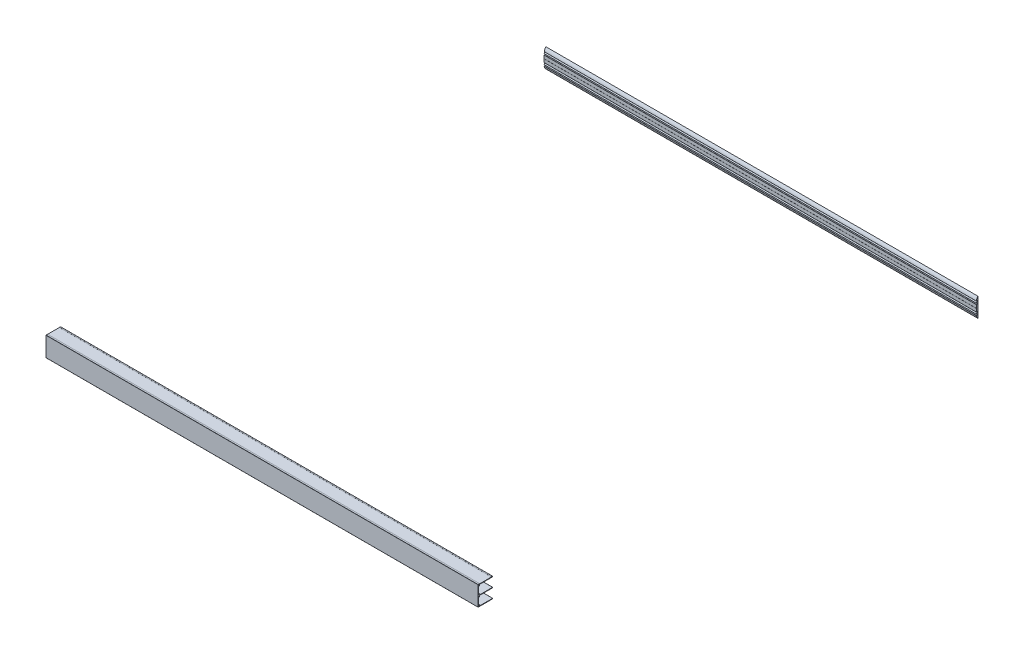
ISO-10303-21;
HEADER;
FILE_DESCRIPTION(('STEP AP214'),'2;1');
FILE_NAME('part.step','',(''),(''),'','','');
FILE_SCHEMA(('AUTOMOTIVE_DESIGN { 1 0 10303 214 1 1 1 1 }'));
ENDSEC;
DATA;
#1=APPLICATION_CONTEXT('core data for automotive mechanical design processes');
#2=APPLICATION_PROTOCOL_DEFINITION('international standard','automotive_design',2000,#1);
#3=PRODUCT_CONTEXT('',#1,'mechanical');
#4=PRODUCT('Part','Part','',(#3));
#5=PRODUCT_RELATED_PRODUCT_CATEGORY('part','',(#4));
#6=PRODUCT_DEFINITION_FORMATION('','',#4);
#7=PRODUCT_DEFINITION_CONTEXT('part definition',#1,'design');
#8=PRODUCT_DEFINITION('design','',#6,#7);
#9=PRODUCT_DEFINITION_SHAPE('','',#8);
#10=(LENGTH_UNIT() NAMED_UNIT(*) SI_UNIT(.MILLI.,.METRE.));
#11=(NAMED_UNIT(*) PLANE_ANGLE_UNIT() SI_UNIT($,.RADIAN.));
#12=(NAMED_UNIT(*) SI_UNIT($,.STERADIAN.) SOLID_ANGLE_UNIT());
#13=UNCERTAINTY_MEASURE_WITH_UNIT(LENGTH_MEASURE(1.E-05),#10,'distance_accuracy_value','');
#14=(GEOMETRIC_REPRESENTATION_CONTEXT(3) GLOBAL_UNCERTAINTY_ASSIGNED_CONTEXT((#13)) GLOBAL_UNIT_ASSIGNED_CONTEXT((#10,
#11,#12)) REPRESENTATION_CONTEXT('',''));
#15=CARTESIAN_POINT('',(0.,0.,0.));
#16=DIRECTION('',(0.,0.,1.));
#17=DIRECTION('',(1.,0.,0.));
#18=AXIS2_PLACEMENT_3D('',#15,#16,#17);
#19=CARTESIAN_POINT('',(0.,-39.20000002,1990.));
#20=DIRECTION('',(0.,0.,-1.));
#21=DIRECTION('',(-1.,0.,0.));
#22=AXIS2_PLACEMENT_3D('',#19,#20,#21);
#23=PLANE('',#22);
#24=DIRECTION('',(0.,1.,0.));
#25=VECTOR('',#24,1.);
#26=CARTESIAN_POINT('',(0.,-39.20000002,1990.));
#27=LINE('',#26,#25);
#28=CARTESIAN_POINT('',(0.,-39.80000002,1990.));
#29=VERTEX_POINT('',#28);
#30=CARTESIAN_POINT('',(0.,-38.60000002,1990.));
#31=VERTEX_POINT('',#30);
#32=EDGE_CURVE('P0_E334',#29,#31,#27,.T.);
#33=ORIENTED_EDGE('',*,*,#32,.T.);
#34=DIRECTION('',(1.,0.,0.));
#35=VECTOR('',#34,1.);
#36=CARTESIAN_POINT('',(0.,-38.60000002,1990.));
#37=LINE('',#36,#35);
#38=CARTESIAN_POINT('',(1772.,-38.60000002,1990.));
#39=VERTEX_POINT('',#38);
#40=EDGE_CURVE('P0_E332',#39,#31,#37,.F.);
#41=ORIENTED_EDGE('',*,*,#40,.F.);
#42=DIRECTION('',(0.,1.,0.));
#43=VECTOR('',#42,1.);
#44=CARTESIAN_POINT('',(1772.,-39.20000002,1990.));
#45=LINE('',#44,#43);
#46=CARTESIAN_POINT('',(1772.,-39.80000002,1990.));
#47=VERTEX_POINT('',#46);
#48=EDGE_CURVE('P0_E316',#39,#47,#45,.F.);
#49=ORIENTED_EDGE('',*,*,#48,.T.);
#50=DIRECTION('',(1.,0.,0.));
#51=VECTOR('',#50,1.);
#52=CARTESIAN_POINT('',(0.,-39.80000002,1990.));
#53=LINE('',#52,#51);
#54=EDGE_CURVE('P0_E329',#29,#47,#53,.T.);
#55=ORIENTED_EDGE('',*,*,#54,.F.);
#56=EDGE_LOOP('',(#33,#41,#49,#55));
#57=FACE_BOUND('',#56,.T.);
#58=ADVANCED_FACE('P0_F17',(#57),#23,.T.);
#59=CARTESIAN_POINT('',(0.,-35.1885621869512,2046.));
#60=DIRECTION('',(0.,0.,1.));
#61=DIRECTION('',(1.,0.,0.));
#62=AXIS2_PLACEMENT_3D('',#59,#60,#61);
#63=PLANE('',#62);
#64=DIRECTION('',(0.,1.,0.));
#65=VECTOR('',#64,1.);
#66=CARTESIAN_POINT('',(0.,-35.1885621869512,2046.));
#67=LINE('',#66,#65);
#68=CARTESIAN_POINT('',(0.,-34.90000002,2046.));
#69=VERTEX_POINT('',#68);
#70=CARTESIAN_POINT('',(0.,-35.4771243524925,2045.99999999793));
#71=VERTEX_POINT('',#70);
#72=EDGE_CURVE('P0_E510',#69,#71,#67,.F.);
#73=ORIENTED_EDGE('',*,*,#72,.T.);
#74=DIRECTION('',(1.,0.,0.));
#75=VECTOR('',#74,1.);
#76=CARTESIAN_POINT('',(0.,-35.477124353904,2045.99999999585));
#77=LINE('',#76,#75);
#78=CARTESIAN_POINT('',(1772.,-35.4771243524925,2045.99999999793));
#79=VERTEX_POINT('',#78);
#80=EDGE_CURVE('P0_E523',#71,#79,#77,.T.);
#81=ORIENTED_EDGE('',*,*,#80,.T.);
#82=DIRECTION('',(0.,1.,0.));
#83=VECTOR('',#82,1.);
#84=CARTESIAN_POINT('',(1772.,-35.1885621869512,2046.));
#85=LINE('',#84,#83);
#86=CARTESIAN_POINT('',(1772.,-34.90000002,2046.));
#87=VERTEX_POINT('',#86);
#88=EDGE_CURVE('P0_E508',#79,#87,#85,.T.);
#89=ORIENTED_EDGE('',*,*,#88,.T.);
#90=DIRECTION('',(1.,0.,0.));
#91=VECTOR('',#90,1.);
#92=CARTESIAN_POINT('',(0.,-34.90000002,2046.));
#93=LINE('',#92,#91);
#94=EDGE_CURVE('P0_E528',#69,#87,#93,.T.);
#95=ORIENTED_EDGE('',*,*,#94,.F.);
#96=EDGE_LOOP('',(#73,#81,#89,#95));
#97=FACE_BOUND('',#96,.T.);
#98=ADVANCED_FACE('P0_F1776',(#97),#63,.T.);
#99=CARTESIAN_POINT('',(0.,-0.25000001,1990.));
#100=DIRECTION('',(0.,0.,-1.));
#101=DIRECTION('',(-1.,0.,0.));
#102=AXIS2_PLACEMENT_3D('',#99,#100,#101);
#103=PLANE('',#102);
#104=DIRECTION('',(0.,1.,0.));
#105=VECTOR('',#104,1.);
#106=CARTESIAN_POINT('',(0.,-0.25000001,1990.));
#107=LINE('',#106,#105);
#108=CARTESIAN_POINT('',(0.,-0.500000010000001,1990.));
#109=VERTEX_POINT('',#108);
#110=CARTESIAN_POINT('',(0.,0.499999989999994,1990.));
#111=VERTEX_POINT('',#110);
#112=EDGE_CURVE('P0_E615',#109,#111,#107,.T.);
#113=ORIENTED_EDGE('',*,*,#112,.T.);
#114=DIRECTION('',(1.,0.,0.));
#115=VECTOR('',#114,1.);
#116=CARTESIAN_POINT('',(0.,0.499999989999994,1990.));
#117=LINE('',#116,#115);
#118=CARTESIAN_POINT('',(1772.,0.499999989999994,1990.));
#119=VERTEX_POINT('',#118);
#120=EDGE_CURVE('P0_E479',#119,#111,#117,.F.);
#121=ORIENTED_EDGE('',*,*,#120,.F.);
#122=DIRECTION('',(0.,1.,0.));
#123=VECTOR('',#122,1.);
#124=CARTESIAN_POINT('',(1772.,-0.25000001,1990.));
#125=LINE('',#124,#123);
#126=CARTESIAN_POINT('',(1772.,-0.500000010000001,1990.));
#127=VERTEX_POINT('',#126);
#128=EDGE_CURVE('P0_E519',#119,#127,#125,.F.);
#129=ORIENTED_EDGE('',*,*,#128,.T.);
#130=DIRECTION('',(1.,0.,0.));
#131=VECTOR('',#130,1.);
#132=CARTESIAN_POINT('',(0.,-0.500000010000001,1990.));
#133=LINE('',#132,#131);
#134=EDGE_CURVE('P0_E483',#109,#127,#133,.T.);
#135=ORIENTED_EDGE('',*,*,#134,.F.);
#136=EDGE_LOOP('',(#113,#121,#129,#135));
#137=FACE_BOUND('',#136,.T.);
#138=ADVANCED_FACE('P0_F1767',(#137),#103,.T.);
#139=CARTESIAN_POINT('',(0.,39.2,1990.));
#140=DIRECTION('',(0.,0.,-1.));
#141=DIRECTION('',(-1.,0.,0.));
#142=AXIS2_PLACEMENT_3D('',#139,#140,#141);
#143=PLANE('',#142);
#144=DIRECTION('',(0.,1.,0.));
#145=VECTOR('',#144,1.);
#146=CARTESIAN_POINT('',(0.,39.2,1990.));
#147=LINE('',#146,#145);
#148=CARTESIAN_POINT('',(0.,38.6,1990.));
#149=VERTEX_POINT('',#148);
#150=CARTESIAN_POINT('',(0.,39.8,1990.));
#151=VERTEX_POINT('',#150);
#152=EDGE_CURVE('P0_E552',#149,#151,#147,.T.);
#153=ORIENTED_EDGE('',*,*,#152,.T.);
#154=DIRECTION('',(1.,0.,0.));
#155=VECTOR('',#154,1.);
#156=CARTESIAN_POINT('',(0.,39.8,1990.));
#157=LINE('',#156,#155);
#158=CARTESIAN_POINT('',(1772.,39.8,1990.));
#159=VERTEX_POINT('',#158);
#160=EDGE_CURVE('P0_E463',#159,#151,#157,.F.);
#161=ORIENTED_EDGE('',*,*,#160,.F.);
#162=DIRECTION('',(0.,1.,0.));
#163=VECTOR('',#162,1.);
#164=CARTESIAN_POINT('',(1772.,39.2,1990.));
#165=LINE('',#164,#163);
#166=CARTESIAN_POINT('',(1772.,38.6,1990.));
#167=VERTEX_POINT('',#166);
#168=EDGE_CURVE('P0_E612',#159,#167,#165,.F.);
#169=ORIENTED_EDGE('',*,*,#168,.T.);
#170=DIRECTION('',(1.,0.,0.));
#171=VECTOR('',#170,1.);
#172=CARTESIAN_POINT('',(0.,38.6,1990.));
#173=LINE('',#172,#171);
#174=EDGE_CURVE('P0_E467',#149,#167,#173,.T.);
#175=ORIENTED_EDGE('',*,*,#174,.F.);
#176=EDGE_LOOP('',(#153,#161,#169,#175));
#177=FACE_BOUND('',#176,.T.);
#178=ADVANCED_FACE('P0_F1758',(#177),#143,.T.);
#179=CARTESIAN_POINT('',(0.,-40.20000002,1995.));
#180=DIRECTION('',(0.,0.,1.));
#181=DIRECTION('',(1.,0.,0.));
#182=AXIS2_PLACEMENT_3D('',#179,#180,#181);
#183=PLANE('',#182);
#184=DIRECTION('',(0.,1.,0.));
#185=VECTOR('',#184,1.);
#186=CARTESIAN_POINT('',(0.,-40.20000002,1995.));
#187=LINE('',#186,#185);
#188=CARTESIAN_POINT('',(0.,-40.10000002,1995.));
#189=VERTEX_POINT('',#188);
#190=CARTESIAN_POINT('',(0.,-40.30000002,1995.));
#191=VERTEX_POINT('',#190);
#192=EDGE_CURVE('P0_E326',#189,#191,#187,.F.);
#193=ORIENTED_EDGE('',*,*,#192,.T.);
#194=DIRECTION('',(1.,0.,0.));
#195=VECTOR('',#194,1.);
#196=CARTESIAN_POINT('',(0.,-40.30000002,1995.));
#197=LINE('',#196,#195);
#198=CARTESIAN_POINT('',(1772.,-40.30000002,1995.));
#199=VERTEX_POINT('',#198);
#200=EDGE_CURVE('P0_E351',#199,#191,#197,.F.);
#201=ORIENTED_EDGE('',*,*,#200,.F.);
#202=DIRECTION('',(0.,1.,0.));
#203=VECTOR('',#202,1.);
#204=CARTESIAN_POINT('',(1772.,-40.20000002,1995.));
#205=LINE('',#204,#203);
#206=CARTESIAN_POINT('',(1772.,-40.10000002,1995.));
#207=VERTEX_POINT('',#206);
#208=EDGE_CURVE('P0_E549',#199,#207,#205,.T.);
#209=ORIENTED_EDGE('',*,*,#208,.T.);
#210=DIRECTION('',(1.,0.,0.));
#211=VECTOR('',#210,1.);
#212=CARTESIAN_POINT('',(0.,-40.10000002,1995.));
#213=LINE('',#212,#211);
#214=EDGE_CURVE('P0_E347',#189,#207,#213,.T.);
#215=ORIENTED_EDGE('',*,*,#214,.F.);
#216=EDGE_LOOP('',(#193,#201,#209,#215));
#217=FACE_BOUND('',#216,.T.);
#218=ADVANCED_FACE('P0_F1220',(#217),#183,.T.);
#219=CARTESIAN_POINT('',(0.,-39.80000002,1990.5));
#220=DIRECTION('',(1.,0.,0.));
#221=DIRECTION('',(0.,0.,-1.));
#222=AXIS2_PLACEMENT_3D('',#219,#220,#221);
#223=CYLINDRICAL_SURFACE('',#222,0.500000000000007);
#224=CARTESIAN_POINT('',(0.,-39.80000002,1990.5));
#225=DIRECTION('',(1.,0.,0.));
#226=DIRECTION('',(0.,0.,-1.));
#227=AXIS2_PLACEMENT_3D('',#224,#225,#226);
#228=CIRCLE('',#227,0.500000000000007);
#229=CARTESIAN_POINT('',(0.,-40.30000002,1990.5));
#230=VERTEX_POINT('',#229);
#231=EDGE_CURVE('P0_E325',#230,#29,#228,.T.);
#232=ORIENTED_EDGE('',*,*,#231,.T.);
#233=ORIENTED_EDGE('',*,*,#54,.T.);
#234=CARTESIAN_POINT('',(1772.,-39.80000002,1990.5));
#235=DIRECTION('',(1.,0.,0.));
#236=DIRECTION('',(0.,0.,-1.));
#237=AXIS2_PLACEMENT_3D('',#234,#235,#236);
#238=CIRCLE('',#237,0.500000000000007);
#239=CARTESIAN_POINT('',(1772.,-40.30000002,1990.5));
#240=VERTEX_POINT('',#239);
#241=EDGE_CURVE('P0_E20',#47,#240,#238,.F.);
#242=ORIENTED_EDGE('',*,*,#241,.T.);
#243=DIRECTION('',(1.,0.,0.));
#244=VECTOR('',#243,1.);
#245=CARTESIAN_POINT('',(0.,-40.30000002,1990.5));
#246=LINE('',#245,#244);
#247=EDGE_CURVE('P0_E915',#230,#240,#246,.T.);
#248=ORIENTED_EDGE('',*,*,#247,.F.);
#249=EDGE_LOOP('',(#232,#233,#242,#248));
#250=FACE_BOUND('',#249,.T.);
#251=ADVANCED_FACE('P0_F336',(#250),#223,.T.);
#252=CARTESIAN_POINT('',(0.,-38.60000002,1990.5));
#253=DIRECTION('',(1.,0.,0.));
#254=DIRECTION('',(0.,0.,-1.));
#255=AXIS2_PLACEMENT_3D('',#252,#253,#254);
#256=CYLINDRICAL_SURFACE('',#255,0.500000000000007);
#257=CARTESIAN_POINT('',(0.,-38.60000002,1990.5));
#258=DIRECTION('',(1.,0.,0.));
#259=DIRECTION('',(0.,0.,-1.));
#260=AXIS2_PLACEMENT_3D('',#257,#258,#259);
#261=CIRCLE('',#260,0.500000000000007);
#262=CARTESIAN_POINT('',(0.,-38.10000002,1990.5));
#263=VERTEX_POINT('',#262);
#264=EDGE_CURVE('P0_E491',#31,#263,#261,.T.);
#265=ORIENTED_EDGE('',*,*,#264,.T.);
#266=DIRECTION('',(1.,0.,0.));
#267=VECTOR('',#266,1.);
#268=CARTESIAN_POINT('',(0.,-38.10000002,1990.5));
#269=LINE('',#268,#267);
#270=CARTESIAN_POINT('',(1772.,-38.10000002,1990.5));
#271=VERTEX_POINT('',#270);
#272=EDGE_CURVE('P0_E913',#271,#263,#269,.F.);
#273=ORIENTED_EDGE('',*,*,#272,.F.);
#274=CARTESIAN_POINT('',(1772.,-38.60000002,1990.5));
#275=DIRECTION('',(1.,0.,0.));
#276=DIRECTION('',(0.,0.,-1.));
#277=AXIS2_PLACEMENT_3D('',#274,#275,#276);
#278=CIRCLE('',#277,0.500000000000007);
#279=EDGE_CURVE('P0_E338',#271,#39,#278,.F.);
#280=ORIENTED_EDGE('',*,*,#279,.T.);
#281=ORIENTED_EDGE('',*,*,#40,.T.);
#282=EDGE_LOOP('',(#265,#273,#280,#281));
#283=FACE_BOUND('',#282,.T.);
#284=ADVANCED_FACE('P0_F1211',(#283),#256,.T.);
#285=CARTESIAN_POINT('',(0.,-34.90000002,2045.5));
#286=DIRECTION('',(0.,1.,0.));
#287=DIRECTION('',(0.,0.,1.));
#288=AXIS2_PLACEMENT_3D('',#285,#286,#287);
#289=PLANE('',#288);
#290=DIRECTION('',(0.,0.,1.));
#291=VECTOR('',#290,1.);
#292=CARTESIAN_POINT('',(0.,-34.90000002,2045.5));
#293=LINE('',#292,#291);
#294=CARTESIAN_POINT('',(0.,-34.90000002,2045.));
#295=VERTEX_POINT('',#294);
#296=EDGE_CURVE('P0_E501',#295,#69,#293,.T.);
#297=ORIENTED_EDGE('',*,*,#296,.T.);
#298=ORIENTED_EDGE('',*,*,#94,.T.);
#299=DIRECTION('',(0.,0.,1.));
#300=VECTOR('',#299,1.);
#301=CARTESIAN_POINT('',(1772.,-34.90000002,2045.5));
#302=LINE('',#301,#300);
#303=CARTESIAN_POINT('',(1772.,-34.90000002,2045.));
#304=VERTEX_POINT('',#303);
#305=EDGE_CURVE('P0_E493',#87,#304,#302,.F.);
#306=ORIENTED_EDGE('',*,*,#305,.T.);
#307=DIRECTION('',(1.,0.,0.));
#308=VECTOR('',#307,1.);
#309=CARTESIAN_POINT('',(0.,-34.90000002,2045.));
#310=LINE('',#309,#308);
#311=EDGE_CURVE('P0_E890',#295,#304,#310,.T.);
#312=ORIENTED_EDGE('',*,*,#311,.F.);
#313=EDGE_LOOP('',(#297,#298,#306,#312));
#314=FACE_BOUND('',#313,.T.);
#315=ADVANCED_FACE('P0_F1190',(#314),#289,.T.);
#316=CARTESIAN_POINT('',(0.,-19.65000001,2048.15));
#317=DIRECTION('',(0.,0.707106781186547,-0.707106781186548));
#318=DIRECTION('',(0.,0.707106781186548,0.707106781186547));
#319=AXIS2_PLACEMENT_3D('',#316,#317,#318);
#320=PLANE('',#319);
#321=DIRECTION('',(0.,0.707106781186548,0.707106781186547));
#322=VECTOR('',#321,1.);
#323=CARTESIAN_POINT('',(0.,-19.65000001,2048.15));
#324=LINE('',#323,#322);
#325=CARTESIAN_POINT('',(0.,-19.80000001,2048.));
#326=VERTEX_POINT('',#325);
#327=CARTESIAN_POINT('',(0.,-19.50000001,2048.3));
#328=VERTEX_POINT('',#327);
#329=EDGE_CURVE('P0_E688',#326,#328,#324,.T.);
#330=ORIENTED_EDGE('',*,*,#329,.T.);
#331=DIRECTION('',(1.,0.,0.));
#332=VECTOR('',#331,1.);
#333=CARTESIAN_POINT('',(0.,-19.5000000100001,2048.3));
#334=LINE('',#333,#332);
#335=CARTESIAN_POINT('',(1772.,-19.50000001,2048.3));
#336=VERTEX_POINT('',#335);
#337=EDGE_CURVE('P0_E675',#336,#328,#334,.F.);
#338=ORIENTED_EDGE('',*,*,#337,.F.);
#339=DIRECTION('',(0.,0.707106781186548,0.707106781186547));
#340=VECTOR('',#339,1.);
#341=CARTESIAN_POINT('',(1772.,-19.65000001,2048.15));
#342=LINE('',#341,#340);
#343=CARTESIAN_POINT('',(1772.,-19.80000001,2048.));
#344=VERTEX_POINT('',#343);
#345=EDGE_CURVE('P0_E534',#336,#344,#342,.F.);
#346=ORIENTED_EDGE('',*,*,#345,.T.);
#347=DIRECTION('',(-1.,0.,0.));
#348=VECTOR('',#347,1.);
#349=CARTESIAN_POINT('',(0.,-19.80000001,2048.));
#350=LINE('',#349,#348);
#351=EDGE_CURVE('P0_E710',#326,#344,#350,.F.);
#352=ORIENTED_EDGE('',*,*,#351,.F.);
#353=EDGE_LOOP('',(#330,#338,#346,#352));
#354=FACE_BOUND('',#353,.T.);
#355=ADVANCED_FACE('P0_F709',(#354),#320,.T.);
#356=CARTESIAN_POINT('',(0.,-19.35000001,2048.15));
#357=DIRECTION('',(0.,-0.707106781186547,-0.707106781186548));
#358=DIRECTION('',(0.,0.707106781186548,-0.707106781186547));
#359=AXIS2_PLACEMENT_3D('',#356,#357,#358);
#360=PLANE('',#359);
#361=DIRECTION('',(0.,0.707106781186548,-0.707106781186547));
#362=VECTOR('',#361,1.);
#363=CARTESIAN_POINT('',(0.,-19.35000001,2048.15));
#364=LINE('',#363,#362);
#365=CARTESIAN_POINT('',(0.,-19.20000001,2048.));
#366=VERTEX_POINT('',#365);
#367=EDGE_CURVE('P0_E490',#328,#366,#364,.T.);
#368=ORIENTED_EDGE('',*,*,#367,.T.);
#369=DIRECTION('',(-1.,0.,0.));
#370=VECTOR('',#369,1.);
#371=CARTESIAN_POINT('',(0.,-19.20000001,2048.));
#372=LINE('',#371,#370);
#373=CARTESIAN_POINT('',(1772.,-19.20000001,2048.));
#374=VERTEX_POINT('',#373);
#375=EDGE_CURVE('P0_E720',#374,#366,#372,.T.);
#376=ORIENTED_EDGE('',*,*,#375,.F.);
#377=DIRECTION('',(0.,0.707106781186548,-0.707106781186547));
#378=VECTOR('',#377,1.);
#379=CARTESIAN_POINT('',(1772.,-19.35000001,2048.15));
#380=LINE('',#379,#378);
#381=EDGE_CURVE('P0_E678',#374,#336,#380,.F.);
#382=ORIENTED_EDGE('',*,*,#381,.T.);
#383=ORIENTED_EDGE('',*,*,#337,.T.);
#384=EDGE_LOOP('',(#368,#376,#382,#383));
#385=FACE_BOUND('',#384,.T.);
#386=ADVANCED_FACE('P0_F1401',(#385),#360,.T.);
#387=CARTESIAN_POINT('',(0.,-0.500000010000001,1990.5));
#388=DIRECTION('',(1.,0.,0.));
#389=DIRECTION('',(0.,0.,-1.));
#390=AXIS2_PLACEMENT_3D('',#387,#388,#389);
#391=CYLINDRICAL_SURFACE('',#390,0.499999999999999);
#392=CARTESIAN_POINT('',(0.,-0.500000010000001,1990.5));
#393=DIRECTION('',(1.,0.,0.));
#394=DIRECTION('',(0.,0.,-1.));
#395=AXIS2_PLACEMENT_3D('',#392,#393,#394);
#396=CIRCLE('',#395,0.499999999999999);
#397=CARTESIAN_POINT('',(0.,-1.00000001,1990.5));
#398=VERTEX_POINT('',#397);
#399=EDGE_CURVE('P0_E484',#398,#109,#396,.T.);
#400=ORIENTED_EDGE('',*,*,#399,.T.);
#401=ORIENTED_EDGE('',*,*,#134,.T.);
#402=CARTESIAN_POINT('',(1772.,-0.500000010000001,1990.5));
#403=DIRECTION('',(1.,0.,0.));
#404=DIRECTION('',(0.,0.,-1.));
#405=AXIS2_PLACEMENT_3D('',#402,#403,#404);
#406=CIRCLE('',#405,0.499999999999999);
#407=CARTESIAN_POINT('',(1772.,-1.00000001,1990.5));
#408=VERTEX_POINT('',#407);
#409=EDGE_CURVE('P0_E488',#127,#408,#406,.F.);
#410=ORIENTED_EDGE('',*,*,#409,.T.);
#411=DIRECTION('',(1.,0.,0.));
#412=VECTOR('',#411,1.);
#413=CARTESIAN_POINT('',(0.,-1.00000001,1990.5));
#414=LINE('',#413,#412);
#415=EDGE_CURVE('P0_E842',#398,#408,#414,.T.);
#416=ORIENTED_EDGE('',*,*,#415,.F.);
#417=EDGE_LOOP('',(#400,#401,#410,#416));
#418=FACE_BOUND('',#417,.T.);
#419=ADVANCED_FACE('P0_F1397',(#418),#391,.T.);
#420=CARTESIAN_POINT('',(0.,0.499999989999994,1990.5));
#421=DIRECTION('',(1.,0.,0.));
#422=DIRECTION('',(0.,0.,-1.));
#423=AXIS2_PLACEMENT_3D('',#420,#421,#422);
#424=CYLINDRICAL_SURFACE('',#423,0.500000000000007);
#425=CARTESIAN_POINT('',(0.,0.499999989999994,1990.5));
#426=DIRECTION('',(1.,0.,0.));
#427=DIRECTION('',(0.,0.,-1.));
#428=AXIS2_PLACEMENT_3D('',#425,#426,#427);
#429=CIRCLE('',#428,0.500000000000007);
#430=CARTESIAN_POINT('',(0.,0.99999999,1990.5));
#431=VERTEX_POINT('',#430);
#432=EDGE_CURVE('P0_E475',#111,#431,#429,.T.);
#433=ORIENTED_EDGE('',*,*,#432,.T.);
#434=DIRECTION('',(1.,0.,0.));
#435=VECTOR('',#434,1.);
#436=CARTESIAN_POINT('',(0.,0.99999999,1990.5));
#437=LINE('',#436,#435);
#438=CARTESIAN_POINT('',(1772.,0.99999999,1990.5));
#439=VERTEX_POINT('',#438);
#440=EDGE_CURVE('P0_E838',#439,#431,#437,.F.);
#441=ORIENTED_EDGE('',*,*,#440,.F.);
#442=CARTESIAN_POINT('',(1772.,0.499999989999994,1990.5));
#443=DIRECTION('',(1.,0.,0.));
#444=DIRECTION('',(0.,0.,-1.));
#445=AXIS2_PLACEMENT_3D('',#442,#443,#444);
#446=CIRCLE('',#445,0.500000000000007);
#447=EDGE_CURVE('P0_E480',#439,#119,#446,.F.);
#448=ORIENTED_EDGE('',*,*,#447,.T.);
#449=ORIENTED_EDGE('',*,*,#120,.T.);
#450=EDGE_LOOP('',(#433,#441,#448,#449));
#451=FACE_BOUND('',#450,.T.);
#452=ADVANCED_FACE('P0_F1393',(#451),#424,.T.);
#453=CARTESIAN_POINT('',(0.,19.34999999,2048.15));
#454=DIRECTION('',(0.,0.707106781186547,-0.707106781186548));
#455=DIRECTION('',(0.,0.707106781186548,0.707106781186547));
#456=AXIS2_PLACEMENT_3D('',#453,#454,#455);
#457=PLANE('',#456);
#458=DIRECTION('',(0.,0.707106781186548,0.707106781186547));
#459=VECTOR('',#458,1.);
#460=CARTESIAN_POINT('',(0.,19.34999999,2048.15));
#461=LINE('',#460,#459);
#462=CARTESIAN_POINT('',(0.,19.1999999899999,2048.));
#463=VERTEX_POINT('',#462);
#464=CARTESIAN_POINT('',(0.,19.49999999,2048.3));
#465=VERTEX_POINT('',#464);
#466=EDGE_CURVE('P0_E634',#463,#465,#461,.T.);
#467=ORIENTED_EDGE('',*,*,#466,.T.);
#468=DIRECTION('',(1.,0.,0.));
#469=VECTOR('',#468,1.);
#470=CARTESIAN_POINT('',(0.,19.4999999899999,2048.3));
#471=LINE('',#470,#469);
#472=CARTESIAN_POINT('',(1772.,19.4999999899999,2048.3));
#473=VERTEX_POINT('',#472);
#474=EDGE_CURVE('P0_E626',#473,#465,#471,.F.);
#475=ORIENTED_EDGE('',*,*,#474,.F.);
#476=DIRECTION('',(0.,0.707106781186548,0.707106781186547));
#477=VECTOR('',#476,1.);
#478=CARTESIAN_POINT('',(1772.,19.34999999,2048.15));
#479=LINE('',#478,#477);
#480=CARTESIAN_POINT('',(1772.,19.19999999,2048.));
#481=VERTEX_POINT('',#480);
#482=EDGE_CURVE('P0_E478',#473,#481,#479,.F.);
#483=ORIENTED_EDGE('',*,*,#482,.T.);
#484=DIRECTION('',(-1.,0.,0.));
#485=VECTOR('',#484,1.);
#486=CARTESIAN_POINT('',(0.,19.19999999,2048.));
#487=LINE('',#486,#485);
#488=EDGE_CURVE('P0_E644',#463,#481,#487,.F.);
#489=ORIENTED_EDGE('',*,*,#488,.F.);
#490=EDGE_LOOP('',(#467,#475,#483,#489));
#491=FACE_BOUND('',#490,.T.);
#492=ADVANCED_FACE('P0_F1390',(#491),#457,.T.);
#493=CARTESIAN_POINT('',(0.,19.64999999,2048.15));
#494=DIRECTION('',(0.,-0.707106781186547,-0.707106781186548));
#495=DIRECTION('',(0.,0.707106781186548,-0.707106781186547));
#496=AXIS2_PLACEMENT_3D('',#493,#494,#495);
#497=PLANE('',#496);
#498=DIRECTION('',(0.,0.707106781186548,-0.707106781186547));
#499=VECTOR('',#498,1.);
#500=CARTESIAN_POINT('',(0.,19.64999999,2048.15));
#501=LINE('',#500,#499);
#502=CARTESIAN_POINT('',(0.,19.79999999,2048.));
#503=VERTEX_POINT('',#502);
#504=EDGE_CURVE('P0_E630',#465,#503,#501,.T.);
#505=ORIENTED_EDGE('',*,*,#504,.T.);
#506=DIRECTION('',(-1.,0.,0.));
#507=VECTOR('',#506,1.);
#508=CARTESIAN_POINT('',(0.,19.79999999,2048.));
#509=LINE('',#508,#507);
#510=CARTESIAN_POINT('',(1772.,19.79999999,2048.));
#511=VERTEX_POINT('',#510);
#512=EDGE_CURVE('P0_E648',#511,#503,#509,.T.);
#513=ORIENTED_EDGE('',*,*,#512,.F.);
#514=DIRECTION('',(0.,0.707106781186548,-0.707106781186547));
#515=VECTOR('',#514,1.);
#516=CARTESIAN_POINT('',(1772.,19.64999999,2048.15));
#517=LINE('',#516,#515);
#518=EDGE_CURVE('P0_E631',#511,#473,#517,.F.);
#519=ORIENTED_EDGE('',*,*,#518,.T.);
#520=ORIENTED_EDGE('',*,*,#474,.T.);
#521=EDGE_LOOP('',(#505,#513,#519,#520));
#522=FACE_BOUND('',#521,.T.);
#523=ADVANCED_FACE('P0_F996',(#522),#497,.T.);
#524=CARTESIAN_POINT('',(0.,35.18856217,2046.));
#525=DIRECTION('',(0.,0.,1.));
#526=DIRECTION('',(1.,0.,0.));
#527=AXIS2_PLACEMENT_3D('',#524,#525,#526);
#528=PLANE('',#527);
#529=DIRECTION('',(0.,1.,0.));
#530=VECTOR('',#529,1.);
#531=CARTESIAN_POINT('',(0.,35.18856217,2046.));
#532=LINE('',#531,#530);
#533=CARTESIAN_POINT('',(0.,35.4771243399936,2046.));
#534=VERTEX_POINT('',#533);
#535=CARTESIAN_POINT('',(0.,34.9,2046.));
#536=VERTEX_POINT('',#535);
#537=EDGE_CURVE('P0_E970',#534,#536,#532,.F.);
#538=ORIENTED_EDGE('',*,*,#537,.T.);
#539=DIRECTION('',(1.,0.,0.));
#540=VECTOR('',#539,1.);
#541=CARTESIAN_POINT('',(0.,34.9,2046.));
#542=LINE('',#541,#540);
#543=CARTESIAN_POINT('',(1772.,34.9,2046.));
#544=VERTEX_POINT('',#543);
#545=EDGE_CURVE('P0_E619',#544,#536,#542,.F.);
#546=ORIENTED_EDGE('',*,*,#545,.F.);
#547=DIRECTION('',(0.,1.,0.));
#548=VECTOR('',#547,1.);
#549=CARTESIAN_POINT('',(1772.,35.18856217,2046.));
#550=LINE('',#549,#548);
#551=CARTESIAN_POINT('',(1772.,35.4771243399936,2046.));
#552=VERTEX_POINT('',#551);
#553=EDGE_CURVE('P0_E978',#544,#552,#550,.T.);
#554=ORIENTED_EDGE('',*,*,#553,.T.);
#555=DIRECTION('',(1.,0.,0.));
#556=VECTOR('',#555,1.);
#557=CARTESIAN_POINT('',(0.,35.4771243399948,2046.));
#558=LINE('',#557,#556);
#559=EDGE_CURVE('P0_E794',#552,#534,#558,.F.);
#560=ORIENTED_EDGE('',*,*,#559,.T.);
#561=EDGE_LOOP('',(#538,#546,#554,#560));
#562=FACE_BOUND('',#561,.T.);
#563=ADVANCED_FACE('P0_F1383',(#562),#528,.T.);
#564=CARTESIAN_POINT('',(0.,34.9,2045.5));
#565=DIRECTION('',(0.,-1.,0.));
#566=DIRECTION('',(0.,0.,-1.));
#567=AXIS2_PLACEMENT_3D('',#564,#565,#566);
#568=PLANE('',#567);
#569=DIRECTION('',(0.,0.,-1.));
#570=VECTOR('',#569,1.);
#571=CARTESIAN_POINT('',(0.,34.9,2045.5));
#572=LINE('',#571,#570);
#573=CARTESIAN_POINT('',(0.,34.9,2045.));
#574=VERTEX_POINT('',#573);
#575=EDGE_CURVE('P0_E474',#536,#574,#572,.T.);
#576=ORIENTED_EDGE('',*,*,#575,.T.);
#577=DIRECTION('',(1.,0.,0.));
#578=VECTOR('',#577,1.);
#579=CARTESIAN_POINT('',(0.,34.9,2045.));
#580=LINE('',#579,#578);
#581=CARTESIAN_POINT('',(1772.,34.9,2045.));
#582=VERTEX_POINT('',#581);
#583=EDGE_CURVE('P0_E790',#582,#574,#580,.F.);
#584=ORIENTED_EDGE('',*,*,#583,.F.);
#585=DIRECTION('',(0.,0.,-1.));
#586=VECTOR('',#585,1.);
#587=CARTESIAN_POINT('',(1772.,34.9,2045.5));
#588=LINE('',#587,#586);
#589=EDGE_CURVE('P0_E623',#582,#544,#588,.F.);
#590=ORIENTED_EDGE('',*,*,#589,.T.);
#591=ORIENTED_EDGE('',*,*,#545,.T.);
#592=EDGE_LOOP('',(#576,#584,#590,#591));
#593=FACE_BOUND('',#592,.T.);
#594=ADVANCED_FACE('P0_F1379',(#593),#568,.T.);
#595=CARTESIAN_POINT('',(0.,38.6,1990.5));
#596=DIRECTION('',(1.,0.,0.));
#597=DIRECTION('',(0.,0.,-1.));
#598=AXIS2_PLACEMENT_3D('',#595,#596,#597);
#599=CYLINDRICAL_SURFACE('',#598,0.500000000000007);
#600=CARTESIAN_POINT('',(0.,38.6,1990.5));
#601=DIRECTION('',(1.,0.,0.));
#602=DIRECTION('',(0.,0.,-1.));
#603=AXIS2_PLACEMENT_3D('',#600,#601,#602);
#604=CIRCLE('',#603,0.500000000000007);
#605=CARTESIAN_POINT('',(0.,38.1,1990.5));
#606=VERTEX_POINT('',#605);
#607=EDGE_CURVE('P0_E468',#606,#149,#604,.T.);
#608=ORIENTED_EDGE('',*,*,#607,.T.);
#609=ORIENTED_EDGE('',*,*,#174,.T.);
#610=CARTESIAN_POINT('',(1772.,38.6,1990.5));
#611=DIRECTION('',(1.,0.,0.));
#612=DIRECTION('',(0.,0.,-1.));
#613=AXIS2_PLACEMENT_3D('',#610,#611,#612);
#614=CIRCLE('',#613,0.500000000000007);
#615=CARTESIAN_POINT('',(1772.,38.1,1990.5));
#616=VERTEX_POINT('',#615);
#617=EDGE_CURVE('P0_E472',#167,#616,#614,.F.);
#618=ORIENTED_EDGE('',*,*,#617,.T.);
#619=DIRECTION('',(1.,0.,0.));
#620=VECTOR('',#619,1.);
#621=CARTESIAN_POINT('',(0.,38.1,1990.5));
#622=LINE('',#621,#620);
#623=EDGE_CURVE('P0_E766',#606,#616,#622,.T.);
#624=ORIENTED_EDGE('',*,*,#623,.F.);
#625=EDGE_LOOP('',(#608,#609,#618,#624));
#626=FACE_BOUND('',#625,.T.);
#627=ADVANCED_FACE('P0_F1375',(#626),#599,.T.);
#628=CARTESIAN_POINT('',(0.,39.8,1990.5));
#629=DIRECTION('',(1.,0.,0.));
#630=DIRECTION('',(0.,0.,-1.));
#631=AXIS2_PLACEMENT_3D('',#628,#629,#630);
#632=CYLINDRICAL_SURFACE('',#631,0.500000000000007);
#633=CARTESIAN_POINT('',(0.,39.8,1990.5));
#634=DIRECTION('',(1.,0.,0.));
#635=DIRECTION('',(0.,0.,-1.));
#636=AXIS2_PLACEMENT_3D('',#633,#634,#635);
#637=CIRCLE('',#636,0.500000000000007);
#638=CARTESIAN_POINT('',(0.,40.3,1990.5));
#639=VERTEX_POINT('',#638);
#640=EDGE_CURVE('P0_E459',#151,#639,#637,.T.);
#641=ORIENTED_EDGE('',*,*,#640,.T.);
#642=DIRECTION('',(1.,0.,0.));
#643=VECTOR('',#642,1.);
#644=CARTESIAN_POINT('',(0.,40.3,1990.5));
#645=LINE('',#644,#643);
#646=CARTESIAN_POINT('',(1772.,40.3,1990.5));
#647=VERTEX_POINT('',#646);
#648=EDGE_CURVE('P0_E762',#647,#639,#645,.F.);
#649=ORIENTED_EDGE('',*,*,#648,.F.);
#650=CARTESIAN_POINT('',(1772.,39.8,1990.5));
#651=DIRECTION('',(1.,0.,0.));
#652=DIRECTION('',(0.,0.,-1.));
#653=AXIS2_PLACEMENT_3D('',#650,#651,#652);
#654=CIRCLE('',#653,0.500000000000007);
#655=EDGE_CURVE('P0_E464',#647,#159,#654,.F.);
#656=ORIENTED_EDGE('',*,*,#655,.T.);
#657=ORIENTED_EDGE('',*,*,#160,.T.);
#658=EDGE_LOOP('',(#641,#649,#656,#657));
#659=FACE_BOUND('',#658,.T.);
#660=ADVANCED_FACE('P0_F1371',(#659),#632,.T.);
#661=CARTESIAN_POINT('',(0.,40.2,1995.));
#662=DIRECTION('',(0.,0.,1.));
#663=DIRECTION('',(1.,0.,0.));
#664=AXIS2_PLACEMENT_3D('',#661,#662,#663);
#665=PLANE('',#664);
#666=DIRECTION('',(0.,1.,0.));
#667=VECTOR('',#666,1.);
#668=CARTESIAN_POINT('',(0.,40.2,1995.));
#669=LINE('',#668,#667);
#670=CARTESIAN_POINT('',(0.,40.3,1995.));
#671=VERTEX_POINT('',#670);
#672=CARTESIAN_POINT('',(0.,40.1,1995.));
#673=VERTEX_POINT('',#672);
#674=EDGE_CURVE('P0_E951',#671,#673,#669,.F.);
#675=ORIENTED_EDGE('',*,*,#674,.T.);
#676=DIRECTION('',(1.,0.,0.));
#677=VECTOR('',#676,1.);
#678=CARTESIAN_POINT('',(0.,40.1,1995.));
#679=LINE('',#678,#677);
#680=CARTESIAN_POINT('',(1772.,40.1,1995.));
#681=VERTEX_POINT('',#680);
#682=EDGE_CURVE('P0_E585',#681,#673,#679,.F.);
#683=ORIENTED_EDGE('',*,*,#682,.F.);
#684=DIRECTION('',(0.,1.,0.));
#685=VECTOR('',#684,1.);
#686=CARTESIAN_POINT('',(1772.,40.2,1995.));
#687=LINE('',#686,#685);
#688=CARTESIAN_POINT('',(1772.,40.3,1995.));
#689=VERTEX_POINT('',#688);
#690=EDGE_CURVE('P0_E462',#681,#689,#687,.T.);
#691=ORIENTED_EDGE('',*,*,#690,.T.);
#692=DIRECTION('',(1.,0.,0.));
#693=VECTOR('',#692,1.);
#694=CARTESIAN_POINT('',(0.,40.3,1995.));
#695=LINE('',#694,#693);
#696=EDGE_CURVE('P0_E604',#671,#689,#695,.T.);
#697=ORIENTED_EDGE('',*,*,#696,.F.);
#698=EDGE_LOOP('',(#675,#683,#691,#697));
#699=FACE_BOUND('',#698,.T.);
#700=ADVANCED_FACE('P0_F1367',(#699),#665,.T.);
#701=CARTESIAN_POINT('',(0.,40.2,2043.5));
#702=DIRECTION('',(0.,0.,-1.));
#703=DIRECTION('',(-1.,0.,0.));
#704=AXIS2_PLACEMENT_3D('',#701,#702,#703);
#705=PLANE('',#704);
#706=DIRECTION('',(0.,1.,0.));
#707=VECTOR('',#706,1.);
#708=CARTESIAN_POINT('',(0.,40.2,2043.5));
#709=LINE('',#708,#707);
#710=CARTESIAN_POINT('',(0.,40.1,2043.5));
#711=VERTEX_POINT('',#710);
#712=CARTESIAN_POINT('',(0.,40.3,2043.5));
#713=VERTEX_POINT('',#712);
#714=EDGE_CURVE('P0_E945',#711,#713,#709,.T.);
#715=ORIENTED_EDGE('',*,*,#714,.T.);
#716=DIRECTION('',(1.,0.,0.));
#717=VECTOR('',#716,1.);
#718=CARTESIAN_POINT('',(0.,40.3,2043.5));
#719=LINE('',#718,#717);
#720=CARTESIAN_POINT('',(1772.,40.3,2043.5));
#721=VERTEX_POINT('',#720);
#722=EDGE_CURVE('P0_E584',#721,#713,#719,.F.);
#723=ORIENTED_EDGE('',*,*,#722,.F.);
#724=DIRECTION('',(0.,1.,0.));
#725=VECTOR('',#724,1.);
#726=CARTESIAN_POINT('',(1772.,40.2,2043.5));
#727=LINE('',#726,#725);
#728=CARTESIAN_POINT('',(1772.,40.1,2043.5));
#729=VERTEX_POINT('',#728);
#730=EDGE_CURVE('P0_E948',#721,#729,#727,.F.);
#731=ORIENTED_EDGE('',*,*,#730,.T.);
#732=DIRECTION('',(1.,0.,0.));
#733=VECTOR('',#732,1.);
#734=CARTESIAN_POINT('',(0.,40.1,2043.5));
#735=LINE('',#734,#733);
#736=EDGE_CURVE('P0_E580',#711,#729,#735,.T.);
#737=ORIENTED_EDGE('',*,*,#736,.F.);
#738=EDGE_LOOP('',(#715,#723,#731,#737));
#739=FACE_BOUND('',#738,.T.);
#740=ADVANCED_FACE('P0_F1363',(#739),#705,.T.);
#741=CARTESIAN_POINT('',(0.,-40.20000002,2043.5));
#742=DIRECTION('',(0.,0.,-1.));
#743=DIRECTION('',(-1.,0.,0.));
#744=AXIS2_PLACEMENT_3D('',#741,#742,#743);
#745=PLANE('',#744);
#746=DIRECTION('',(0.,1.,0.));
#747=VECTOR('',#746,1.);
#748=CARTESIAN_POINT('',(0.,-40.20000002,2043.5));
#749=LINE('',#748,#747);
#750=CARTESIAN_POINT('',(0.,-40.30000002,2043.5));
#751=VERTEX_POINT('',#750);
#752=CARTESIAN_POINT('',(0.,-40.10000002,2043.5));
#753=VERTEX_POINT('',#752);
#754=EDGE_CURVE('P0_E563',#751,#753,#749,.T.);
#755=ORIENTED_EDGE('',*,*,#754,.T.);
#756=DIRECTION('',(1.,0.,0.));
#757=VECTOR('',#756,1.);
#758=CARTESIAN_POINT('',(0.,-40.10000002,2043.5));
#759=LINE('',#758,#757);
#760=CARTESIAN_POINT('',(1772.,-40.10000002,2043.5));
#761=VERTEX_POINT('',#760);
#762=EDGE_CURVE('P0_E352',#761,#753,#759,.F.);
#763=ORIENTED_EDGE('',*,*,#762,.F.);
#764=DIRECTION('',(0.,1.,0.));
#765=VECTOR('',#764,1.);
#766=CARTESIAN_POINT('',(1772.,-40.20000002,2043.5));
#767=LINE('',#766,#765);
#768=CARTESIAN_POINT('',(1772.,-40.30000002,2043.5));
#769=VERTEX_POINT('',#768);
#770=EDGE_CURVE('P0_E940',#761,#769,#767,.F.);
#771=ORIENTED_EDGE('',*,*,#770,.T.);
#772=DIRECTION('',(1.,0.,0.));
#773=VECTOR('',#772,1.);
#774=CARTESIAN_POINT('',(0.,-40.30000002,2043.5));
#775=LINE('',#774,#773);
#776=EDGE_CURVE('P0_E747',#751,#769,#775,.T.);
#777=ORIENTED_EDGE('',*,*,#776,.F.);
#778=EDGE_LOOP('',(#755,#763,#771,#777));
#779=FACE_BOUND('',#778,.T.);
#780=ADVANCED_FACE('P0_F1359',(#779),#745,.T.);
#781=CARTESIAN_POINT('',(0.,-40.10000002,2019.25));
#782=DIRECTION('',(0.,-1.,0.));
#783=DIRECTION('',(0.,0.,-1.));
#784=AXIS2_PLACEMENT_3D('',#781,#782,#783);
#785=PLANE('',#784);
#786=DIRECTION('',(0.,0.,-1.));
#787=VECTOR('',#786,1.);
#788=CARTESIAN_POINT('',(0.,-40.10000002,2028.75559155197));
#789=LINE('',#788,#787);
#790=EDGE_CURVE('P0_E566',#753,#189,#789,.T.);
#791=ORIENTED_EDGE('',*,*,#790,.T.);
#792=ORIENTED_EDGE('',*,*,#214,.T.);
#793=DIRECTION('',(0.,0.,-1.));
#794=VECTOR('',#793,1.);
#795=CARTESIAN_POINT('',(1772.,-40.10000002,2028.75559155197));
#796=LINE('',#795,#794);
#797=EDGE_CURVE('P0_E574',#761,#207,#796,.T.);
#798=ORIENTED_EDGE('',*,*,#797,.F.);
#799=ORIENTED_EDGE('',*,*,#762,.T.);
#800=EDGE_LOOP('',(#791,#792,#798,#799));
#801=FACE_BOUND('',#800,.T.);
#802=ADVANCED_FACE('P0_F1355',(#801),#785,.T.);
#803=CARTESIAN_POINT('',(0.,-40.30000002,1992.75));
#804=DIRECTION('',(0.,-1.,0.));
#805=DIRECTION('',(0.,0.,-1.));
#806=AXIS2_PLACEMENT_3D('',#803,#804,#805);
#807=PLANE('',#806);
#808=DIRECTION('',(0.,0.,-1.));
#809=VECTOR('',#808,1.);
#810=CARTESIAN_POINT('',(0.,-40.30000002,2028.75559155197));
#811=LINE('',#810,#809);
#812=EDGE_CURVE('P0_E570',#191,#230,#811,.T.);
#813=ORIENTED_EDGE('',*,*,#812,.T.);
#814=ORIENTED_EDGE('',*,*,#247,.T.);
#815=DIRECTION('',(0.,0.,-1.));
#816=VECTOR('',#815,1.);
#817=CARTESIAN_POINT('',(1772.,-40.30000002,2028.75559155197));
#818=LINE('',#817,#816);
#819=EDGE_CURVE('P0_E320',#199,#240,#818,.T.);
#820=ORIENTED_EDGE('',*,*,#819,.F.);
#821=ORIENTED_EDGE('',*,*,#200,.T.);
#822=EDGE_LOOP('',(#813,#814,#820,#821));
#823=FACE_BOUND('',#822,.T.);
#824=ADVANCED_FACE('P0_F1352',(#823),#807,.T.);
#825=CARTESIAN_POINT('',(0.,-38.10000002,2016.25));
#826=DIRECTION('',(0.,1.,0.));
#827=DIRECTION('',(0.,0.,1.));
#828=AXIS2_PLACEMENT_3D('',#825,#826,#827);
#829=PLANE('',#828);
#830=DIRECTION('',(0.,0.,-1.));
#831=VECTOR('',#830,1.);
#832=CARTESIAN_POINT('',(0.,-38.10000002,2028.75559155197));
#833=LINE('',#832,#831);
#834=CARTESIAN_POINT('',(0.,-38.10000002,2042.));
#835=VERTEX_POINT('',#834);
#836=EDGE_CURVE('P0_E409',#263,#835,#833,.F.);
#837=ORIENTED_EDGE('',*,*,#836,.T.);
#838=DIRECTION('',(1.,0.,0.));
#839=VECTOR('',#838,1.);
#840=CARTESIAN_POINT('',(0.,-38.10000002,2042.));
#841=LINE('',#840,#839);
#842=CARTESIAN_POINT('',(1772.,-38.10000002,2042.));
#843=VERTEX_POINT('',#842);
#844=EDGE_CURVE('P0_E911',#835,#843,#841,.T.);
#845=ORIENTED_EDGE('',*,*,#844,.T.);
#846=DIRECTION('',(0.,0.,-1.));
#847=VECTOR('',#846,1.);
#848=CARTESIAN_POINT('',(1772.,-38.10000002,2028.75559155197));
#849=LINE('',#848,#847);
#850=EDGE_CURVE('P0_E458',#271,#843,#849,.F.);
#851=ORIENTED_EDGE('',*,*,#850,.F.);
#852=ORIENTED_EDGE('',*,*,#272,.T.);
#853=EDGE_LOOP('',(#837,#845,#851,#852));
#854=FACE_BOUND('',#853,.T.);
#855=ADVANCED_FACE('P0_F1209',(#854),#829,.T.);
#856=CARTESIAN_POINT('',(0.,-36.60000002,2042.));
#857=DIRECTION('',(1.,0.,0.));
#858=DIRECTION('',(0.,0.,-1.));
#859=AXIS2_PLACEMENT_3D('',#856,#857,#858);
#860=CYLINDRICAL_SURFACE('',#859,1.49999999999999);
#861=ORIENTED_EDGE('',*,*,#844,.F.);
#862=CARTESIAN_POINT('',(0.,-36.60000002,2042.));
#863=DIRECTION('',(1.,0.,0.));
#864=DIRECTION('',(0.,0.,-1.));
#865=AXIS2_PLACEMENT_3D('',#862,#863,#864);
#866=CIRCLE('',#865,1.49999999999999);
#867=CARTESIAN_POINT('',(0.,-36.60000002,2043.5));
#868=VERTEX_POINT('',#867);
#869=EDGE_CURVE('P0_E406',#835,#868,#866,.F.);
#870=ORIENTED_EDGE('',*,*,#869,.T.);
#871=DIRECTION('',(-1.,0.,0.));
#872=VECTOR('',#871,1.);
#873=CARTESIAN_POINT('',(0.,-36.60000002,2043.5));
#874=LINE('',#873,#872);
#875=CARTESIAN_POINT('',(1772.,-36.60000002,2043.5));
#876=VERTEX_POINT('',#875);
#877=EDGE_CURVE('P0_E907',#876,#868,#874,.T.);
#878=ORIENTED_EDGE('',*,*,#877,.F.);
#879=CARTESIAN_POINT('',(1772.,-36.60000002,2042.));
#880=DIRECTION('',(1.,0.,0.));
#881=DIRECTION('',(0.,0.,-1.));
#882=AXIS2_PLACEMENT_3D('',#879,#880,#881);
#883=CIRCLE('',#882,1.49999999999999);
#884=EDGE_CURVE('P0_E455',#843,#876,#883,.F.);
#885=ORIENTED_EDGE('',*,*,#884,.F.);
#886=EDGE_LOOP('',(#861,#870,#878,#885));
#887=FACE_BOUND('',#886,.T.);
#888=ADVANCED_FACE('P0_F1206',(#887),#860,.F.);
#889=CARTESIAN_POINT('',(0.,-35.50000002,2043.5));
#890=DIRECTION('',(0.,0.,-1.));
#891=DIRECTION('',(-1.,0.,0.));
#892=AXIS2_PLACEMENT_3D('',#889,#890,#891);
#893=PLANE('',#892);
#894=DIRECTION('',(0.,1.,0.));
#895=VECTOR('',#894,1.);
#896=CARTESIAN_POINT('',(0.,-8.09905120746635E-09,2043.5));
#897=LINE('',#896,#895);
#898=CARTESIAN_POINT('',(0.,-34.40000002,2043.5));
#899=VERTEX_POINT('',#898);
#900=EDGE_CURVE('P0_E405',#868,#899,#897,.T.);
#901=ORIENTED_EDGE('',*,*,#900,.T.);
#902=DIRECTION('',(1.,0.,0.));
#903=VECTOR('',#902,1.);
#904=CARTESIAN_POINT('',(0.,-34.40000002,2043.5));
#905=LINE('',#904,#903);
#906=CARTESIAN_POINT('',(1772.,-34.40000002,2043.5));
#907=VERTEX_POINT('',#906);
#908=EDGE_CURVE('P0_E898',#907,#899,#905,.F.);
#909=ORIENTED_EDGE('',*,*,#908,.F.);
#910=DIRECTION('',(0.,1.,0.));
#911=VECTOR('',#910,1.);
#912=CARTESIAN_POINT('',(1772.,-8.09905062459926E-09,2043.5));
#913=LINE('',#912,#911);
#914=EDGE_CURVE('P0_E454',#876,#907,#913,.T.);
#915=ORIENTED_EDGE('',*,*,#914,.F.);
#916=ORIENTED_EDGE('',*,*,#877,.T.);
#917=EDGE_LOOP('',(#901,#909,#915,#916));
#918=FACE_BOUND('',#917,.T.);
#919=ADVANCED_FACE('P0_F1202',(#918),#893,.T.);
#920=CARTESIAN_POINT('',(0.,-34.40000002,2045.));
#921=DIRECTION('',(1.,0.,0.));
#922=DIRECTION('',(0.,0.,-1.));
#923=AXIS2_PLACEMENT_3D('',#920,#921,#922);
#924=CYLINDRICAL_SURFACE('',#923,1.49999999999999);
#925=CARTESIAN_POINT('',(0.,-34.40000002,2045.));
#926=DIRECTION('',(1.,0.,0.));
#927=DIRECTION('',(0.,0.,-1.));
#928=AXIS2_PLACEMENT_3D('',#925,#926,#927);
#929=CIRCLE('',#928,1.49999999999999);
#930=CARTESIAN_POINT('',(0.,-32.90000002,2045.));
#931=VERTEX_POINT('',#930);
#932=EDGE_CURVE('P0_E402',#899,#931,#929,.T.);
#933=ORIENTED_EDGE('',*,*,#932,.T.);
#934=DIRECTION('',(1.,0.,0.));
#935=VECTOR('',#934,1.);
#936=CARTESIAN_POINT('',(0.,-32.90000002,2045.));
#937=LINE('',#936,#935);
#938=CARTESIAN_POINT('',(1772.,-32.90000002,2045.));
#939=VERTEX_POINT('',#938);
#940=EDGE_CURVE('P0_E894',#939,#931,#937,.F.);
#941=ORIENTED_EDGE('',*,*,#940,.F.);
#942=CARTESIAN_POINT('',(1772.,-34.40000002,2045.));
#943=DIRECTION('',(1.,0.,0.));
#944=DIRECTION('',(0.,0.,-1.));
#945=AXIS2_PLACEMENT_3D('',#942,#943,#944);
#946=CIRCLE('',#945,1.49999999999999);
#947=EDGE_CURVE('P0_E451',#907,#939,#946,.T.);
#948=ORIENTED_EDGE('',*,*,#947,.F.);
#949=ORIENTED_EDGE('',*,*,#908,.T.);
#950=EDGE_LOOP('',(#933,#941,#948,#949));
#951=FACE_BOUND('',#950,.T.);
#952=ADVANCED_FACE('P0_F1198',(#951),#924,.T.);
#953=CARTESIAN_POINT('',(0.,-33.90000002,2045.));
#954=DIRECTION('',(0.,0.,1.));
#955=DIRECTION('',(1.,0.,0.));
#956=AXIS2_PLACEMENT_3D('',#953,#954,#955);
#957=PLANE('',#956);
#958=DIRECTION('',(0.,1.,0.));
#959=VECTOR('',#958,1.);
#960=CARTESIAN_POINT('',(0.,-8.09905120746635E-09,2045.));
#961=LINE('',#960,#959);
#962=EDGE_CURVE('P0_E401',#931,#295,#961,.F.);
#963=ORIENTED_EDGE('',*,*,#962,.T.);
#964=ORIENTED_EDGE('',*,*,#311,.T.);
#965=DIRECTION('',(0.,1.,0.));
#966=VECTOR('',#965,1.);
#967=CARTESIAN_POINT('',(1772.,-8.09905062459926E-09,2045.));
#968=LINE('',#967,#966);
#969=EDGE_CURVE('P0_E450',#939,#304,#968,.F.);
#970=ORIENTED_EDGE('',*,*,#969,.F.);
#971=ORIENTED_EDGE('',*,*,#940,.T.);
#972=EDGE_LOOP('',(#963,#964,#970,#971));
#973=FACE_BOUND('',#972,.T.);
#974=ADVANCED_FACE('P0_F1192',(#973),#957,.T.);
#975=CARTESIAN_POINT('',(0.,-36.80000001,2046.9));
#976=DIRECTION('',(1.,0.,0.));
#977=DIRECTION('',(0.,0.,-1.));
#978=AXIS2_PLACEMENT_3D('',#975,#976,#977);
#979=CYLINDRICAL_SURFACE('',#978,1.6000000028);
#980=CARTESIAN_POINT('',(0.,-36.80000001,2046.9));
#981=DIRECTION('',(1.,0.,0.));
#982=DIRECTION('',(0.,0.,-1.));
#983=AXIS2_PLACEMENT_3D('',#980,#981,#982);
#984=CIRCLE('',#983,1.6000000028);
#985=CARTESIAN_POINT('',(0.,-35.638105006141,2048.));
#986=VERTEX_POINT('',#985);
#987=EDGE_CURVE('P0_E397',#71,#986,#984,.F.);
#988=ORIENTED_EDGE('',*,*,#987,.T.);
#989=DIRECTION('',(-1.,0.,0.));
#990=VECTOR('',#989,1.);
#991=CARTESIAN_POINT('',(0.,-35.63810501,2048.));
#992=LINE('',#991,#990);
#993=CARTESIAN_POINT('',(1772.,-35.638105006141,2048.));
#994=VERTEX_POINT('',#993);
#995=EDGE_CURVE('P0_E721',#994,#986,#992,.T.);
#996=ORIENTED_EDGE('',*,*,#995,.F.);
#997=CARTESIAN_POINT('',(1772.,-36.80000001,2046.9));
#998=DIRECTION('',(1.,0.,0.));
#999=DIRECTION('',(0.,0.,-1.));
#1000=AXIS2_PLACEMENT_3D('',#997,#998,#999);
#1001=CIRCLE('',#1000,1.6000000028);
#1002=EDGE_CURVE('P0_E446',#79,#994,#1001,.F.);
#1003=ORIENTED_EDGE('',*,*,#1002,.F.);
#1004=ORIENTED_EDGE('',*,*,#80,.F.);
#1005=EDGE_LOOP('',(#988,#996,#1003,#1004));
#1006=FACE_BOUND('',#1005,.T.);
#1007=ADVANCED_FACE('P0_F1338',(#1006),#979,.F.);
#1008=CARTESIAN_POINT('',(0.,-27.71905251,2048.));
#1009=DIRECTION('',(0.,0.,-1.));
#1010=DIRECTION('',(-1.,0.,0.));
#1011=AXIS2_PLACEMENT_3D('',#1008,#1009,#1010);
#1012=PLANE('',#1011);
#1013=DIRECTION('',(0.,1.,0.));
#1014=VECTOR('',#1013,1.);
#1015=CARTESIAN_POINT('',(0.,-8.09905120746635E-09,2048.));
#1016=LINE('',#1015,#1014);
#1017=EDGE_CURVE('P0_E400',#986,#326,#1016,.T.);
#1018=ORIENTED_EDGE('',*,*,#1017,.T.);
#1019=ORIENTED_EDGE('',*,*,#351,.T.);
#1020=DIRECTION('',(0.,1.,0.));
#1021=VECTOR('',#1020,1.);
#1022=CARTESIAN_POINT('',(1772.,-8.09905062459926E-09,2048.));
#1023=LINE('',#1022,#1021);
#1024=EDGE_CURVE('P0_E449',#994,#344,#1023,.T.);
#1025=ORIENTED_EDGE('',*,*,#1024,.F.);
#1026=ORIENTED_EDGE('',*,*,#995,.T.);
#1027=EDGE_LOOP('',(#1018,#1019,#1025,#1026));
#1028=FACE_BOUND('',#1027,.T.);
#1029=ADVANCED_FACE('P0_F717',(#1028),#1012,.T.);
#1030=CARTESIAN_POINT('',(0.,-11.55000001,2048.));
#1031=DIRECTION('',(0.,0.,-1.));
#1032=DIRECTION('',(-1.,0.,0.));
#1033=AXIS2_PLACEMENT_3D('',#1030,#1031,#1032);
#1034=PLANE('',#1033);
#1035=DIRECTION('',(0.,1.,0.));
#1036=VECTOR('',#1035,1.);
#1037=CARTESIAN_POINT('',(0.,-8.09905120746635E-09,2048.));
#1038=LINE('',#1037,#1036);
#1039=CARTESIAN_POINT('',(0.,-3.90000001,2048.));
#1040=VERTEX_POINT('',#1039);
#1041=EDGE_CURVE('P0_E872',#366,#1040,#1038,.T.);
#1042=ORIENTED_EDGE('',*,*,#1041,.T.);
#1043=DIRECTION('',(1.,0.,0.));
#1044=VECTOR('',#1043,1.);
#1045=CARTESIAN_POINT('',(0.,-3.90000001,2048.));
#1046=LINE('',#1045,#1044);
#1047=CARTESIAN_POINT('',(1772.,-3.90000001,2048.));
#1048=VERTEX_POINT('',#1047);
#1049=EDGE_CURVE('P0_E865',#1048,#1040,#1046,.F.);
#1050=ORIENTED_EDGE('',*,*,#1049,.F.);
#1051=DIRECTION('',(0.,1.,0.));
#1052=VECTOR('',#1051,1.);
#1053=CARTESIAN_POINT('',(1772.,-8.09905062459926E-09,2048.));
#1054=LINE('',#1053,#1052);
#1055=EDGE_CURVE('P0_E723',#374,#1048,#1054,.T.);
#1056=ORIENTED_EDGE('',*,*,#1055,.F.);
#1057=ORIENTED_EDGE('',*,*,#375,.T.);
#1058=EDGE_LOOP('',(#1042,#1050,#1056,#1057));
#1059=FACE_BOUND('',#1058,.T.);
#1060=ADVANCED_FACE('P0_F1332',(#1059),#1034,.T.);
#1061=CARTESIAN_POINT('',(0.,-3.90000001,2046.5));
#1062=DIRECTION('',(0.,-1.,0.));
#1063=DIRECTION('',(0.,0.,-1.));
#1064=AXIS2_PLACEMENT_3D('',#1061,#1062,#1063);
#1065=PLANE('',#1064);
#1066=DIRECTION('',(0.,0.,-1.));
#1067=VECTOR('',#1066,1.);
#1068=CARTESIAN_POINT('',(0.,-3.90000001,2028.75559155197));
#1069=LINE('',#1068,#1067);
#1070=CARTESIAN_POINT('',(0.,-3.90000001,2045.));
#1071=VERTEX_POINT('',#1070);
#1072=EDGE_CURVE('P0_E868',#1040,#1071,#1069,.T.);
#1073=ORIENTED_EDGE('',*,*,#1072,.T.);
#1074=DIRECTION('',(1.,0.,0.));
#1075=VECTOR('',#1074,1.);
#1076=CARTESIAN_POINT('',(0.,-3.90000001,2045.));
#1077=LINE('',#1076,#1075);
#1078=CARTESIAN_POINT('',(1772.,-3.90000001,2045.));
#1079=VERTEX_POINT('',#1078);
#1080=EDGE_CURVE('P0_E861',#1079,#1071,#1077,.F.);
#1081=ORIENTED_EDGE('',*,*,#1080,.F.);
#1082=DIRECTION('',(0.,0.,-1.));
#1083=VECTOR('',#1082,1.);
#1084=CARTESIAN_POINT('',(1772.,-3.90000001,2028.75559155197));
#1085=LINE('',#1084,#1083);
#1086=EDGE_CURVE('P0_E726',#1048,#1079,#1085,.T.);
#1087=ORIENTED_EDGE('',*,*,#1086,.F.);
#1088=ORIENTED_EDGE('',*,*,#1049,.T.);
#1089=EDGE_LOOP('',(#1073,#1081,#1087,#1088));
#1090=FACE_BOUND('',#1089,.T.);
#1091=ADVANCED_FACE('P0_F1329',(#1090),#1065,.T.);
#1092=CARTESIAN_POINT('',(0.,-4.90000001,2045.));
#1093=DIRECTION('',(0.,0.,1.));
#1094=DIRECTION('',(1.,0.,0.));
#1095=AXIS2_PLACEMENT_3D('',#1092,#1093,#1094);
#1096=PLANE('',#1095);
#1097=DIRECTION('',(0.,1.,0.));
#1098=VECTOR('',#1097,1.);
#1099=CARTESIAN_POINT('',(0.,-8.09905120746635E-09,2045.));
#1100=LINE('',#1099,#1098);
#1101=CARTESIAN_POINT('',(0.,-5.90000001,2045.));
#1102=VERTEX_POINT('',#1101);
#1103=EDGE_CURVE('P0_E396',#1071,#1102,#1100,.F.);
#1104=ORIENTED_EDGE('',*,*,#1103,.T.);
#1105=DIRECTION('',(1.,0.,0.));
#1106=VECTOR('',#1105,1.);
#1107=CARTESIAN_POINT('',(0.,-5.90000001,2045.));
#1108=LINE('',#1107,#1106);
#1109=CARTESIAN_POINT('',(1772.,-5.90000001,2045.));
#1110=VERTEX_POINT('',#1109);
#1111=EDGE_CURVE('P0_E857',#1110,#1102,#1108,.F.);
#1112=ORIENTED_EDGE('',*,*,#1111,.F.);
#1113=DIRECTION('',(0.,1.,0.));
#1114=VECTOR('',#1113,1.);
#1115=CARTESIAN_POINT('',(1772.,-8.09905062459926E-09,2045.));
#1116=LINE('',#1115,#1114);
#1117=EDGE_CURVE('P0_E445',#1079,#1110,#1116,.F.);
#1118=ORIENTED_EDGE('',*,*,#1117,.F.);
#1119=ORIENTED_EDGE('',*,*,#1080,.T.);
#1120=EDGE_LOOP('',(#1104,#1112,#1118,#1119));
#1121=FACE_BOUND('',#1120,.T.);
#1122=ADVANCED_FACE('P0_F1101',(#1121),#1096,.T.);
#1123=CARTESIAN_POINT('',(0.,-4.40000001,2045.));
#1124=DIRECTION('',(1.,0.,0.));
#1125=DIRECTION('',(0.,0.,-1.));
#1126=AXIS2_PLACEMENT_3D('',#1123,#1124,#1125);
#1127=CYLINDRICAL_SURFACE('',#1126,1.5);
#1128=CARTESIAN_POINT('',(0.,-4.40000001,2045.));
#1129=DIRECTION('',(1.,0.,0.));
#1130=DIRECTION('',(0.,0.,-1.));
#1131=AXIS2_PLACEMENT_3D('',#1128,#1129,#1130);
#1132=CIRCLE('',#1131,1.5);
#1133=CARTESIAN_POINT('',(0.,-4.40000001,2043.5));
#1134=VERTEX_POINT('',#1133);
#1135=EDGE_CURVE('P0_E393',#1102,#1134,#1132,.T.);
#1136=ORIENTED_EDGE('',*,*,#1135,.T.);
#1137=DIRECTION('',(-1.,0.,0.));
#1138=VECTOR('',#1137,1.);
#1139=CARTESIAN_POINT('',(0.,-4.40000001,2043.5));
#1140=LINE('',#1139,#1138);
#1141=CARTESIAN_POINT('',(1772.,-4.40000001,2043.5));
#1142=VERTEX_POINT('',#1141);
#1143=EDGE_CURVE('P0_E853',#1142,#1134,#1140,.T.);
#1144=ORIENTED_EDGE('',*,*,#1143,.F.);
#1145=CARTESIAN_POINT('',(1772.,-4.40000001,2045.));
#1146=DIRECTION('',(1.,0.,0.));
#1147=DIRECTION('',(0.,0.,-1.));
#1148=AXIS2_PLACEMENT_3D('',#1145,#1146,#1147);
#1149=CIRCLE('',#1148,1.5);
#1150=EDGE_CURVE('P0_E442',#1110,#1142,#1149,.T.);
#1151=ORIENTED_EDGE('',*,*,#1150,.F.);
#1152=ORIENTED_EDGE('',*,*,#1111,.T.);
#1153=EDGE_LOOP('',(#1136,#1144,#1151,#1152));
#1154=FACE_BOUND('',#1153,.T.);
#1155=ADVANCED_FACE('P0_F1322',(#1154),#1127,.T.);
#1156=CARTESIAN_POINT('',(0.,-3.45000001,2043.5));
#1157=DIRECTION('',(0.,0.,-1.));
#1158=DIRECTION('',(-1.,0.,0.));
#1159=AXIS2_PLACEMENT_3D('',#1156,#1157,#1158);
#1160=PLANE('',#1159);
#1161=DIRECTION('',(0.,1.,0.));
#1162=VECTOR('',#1161,1.);
#1163=CARTESIAN_POINT('',(0.,-8.09905120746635E-09,2043.5));
#1164=LINE('',#1163,#1162);
#1165=CARTESIAN_POINT('',(0.,-2.50000001,2043.5));
#1166=VERTEX_POINT('',#1165);
#1167=EDGE_CURVE('P0_E392',#1134,#1166,#1164,.T.);
#1168=ORIENTED_EDGE('',*,*,#1167,.T.);
#1169=DIRECTION('',(1.,0.,0.));
#1170=VECTOR('',#1169,1.);
#1171=CARTESIAN_POINT('',(0.,-2.50000001,2043.5));
#1172=LINE('',#1171,#1170);
#1173=CARTESIAN_POINT('',(1772.,-2.50000001,2043.5));
#1174=VERTEX_POINT('',#1173);
#1175=EDGE_CURVE('P0_E847',#1166,#1174,#1172,.T.);
#1176=ORIENTED_EDGE('',*,*,#1175,.T.);
#1177=DIRECTION('',(0.,1.,0.));
#1178=VECTOR('',#1177,1.);
#1179=CARTESIAN_POINT('',(1772.,-8.09905062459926E-09,2043.5));
#1180=LINE('',#1179,#1178);
#1181=EDGE_CURVE('P0_E441',#1142,#1174,#1180,.T.);
#1182=ORIENTED_EDGE('',*,*,#1181,.F.);
#1183=ORIENTED_EDGE('',*,*,#1143,.T.);
#1184=EDGE_LOOP('',(#1168,#1176,#1182,#1183));
#1185=FACE_BOUND('',#1184,.T.);
#1186=ADVANCED_FACE('P0_F1318',(#1185),#1160,.T.);
#1187=CARTESIAN_POINT('',(0.,-2.50000001,2042.));
#1188=DIRECTION('',(1.,0.,0.));
#1189=DIRECTION('',(0.,0.,-1.));
#1190=AXIS2_PLACEMENT_3D('',#1187,#1188,#1189);
#1191=CYLINDRICAL_SURFACE('',#1190,1.5);
#1192=ORIENTED_EDGE('',*,*,#1175,.F.);
#1193=CARTESIAN_POINT('',(0.,-2.50000001,2042.));
#1194=DIRECTION('',(1.,0.,0.));
#1195=DIRECTION('',(0.,0.,-1.));
#1196=AXIS2_PLACEMENT_3D('',#1193,#1194,#1195);
#1197=CIRCLE('',#1196,1.5);
#1198=CARTESIAN_POINT('',(0.,-1.00000001,2042.));
#1199=VERTEX_POINT('',#1198);
#1200=EDGE_CURVE('P0_E388',#1166,#1199,#1197,.F.);
#1201=ORIENTED_EDGE('',*,*,#1200,.T.);
#1202=DIRECTION('',(1.,0.,0.));
#1203=VECTOR('',#1202,1.);
#1204=CARTESIAN_POINT('',(0.,-1.00000001,2042.));
#1205=LINE('',#1204,#1203);
#1206=CARTESIAN_POINT('',(1772.,-1.00000001,2042.));
#1207=VERTEX_POINT('',#1206);
#1208=EDGE_CURVE('P0_E843',#1207,#1199,#1205,.F.);
#1209=ORIENTED_EDGE('',*,*,#1208,.F.);
#1210=CARTESIAN_POINT('',(1772.,-2.50000001,2042.));
#1211=DIRECTION('',(1.,0.,0.));
#1212=DIRECTION('',(0.,0.,-1.));
#1213=AXIS2_PLACEMENT_3D('',#1210,#1211,#1212);
#1214=CIRCLE('',#1213,1.5);
#1215=EDGE_CURVE('P0_E437',#1174,#1207,#1214,.F.);
#1216=ORIENTED_EDGE('',*,*,#1215,.F.);
#1217=EDGE_LOOP('',(#1192,#1201,#1209,#1216));
#1218=FACE_BOUND('',#1217,.T.);
#1219=ADVANCED_FACE('P0_F1314',(#1218),#1191,.F.);
#1220=CARTESIAN_POINT('',(0.,-1.00000001,2016.25));
#1221=DIRECTION('',(0.,-1.,0.));
#1222=DIRECTION('',(0.,0.,-1.));
#1223=AXIS2_PLACEMENT_3D('',#1220,#1221,#1222);
#1224=PLANE('',#1223);
#1225=DIRECTION('',(0.,0.,-1.));
#1226=VECTOR('',#1225,1.);
#1227=CARTESIAN_POINT('',(0.,-1.00000001,2028.75559155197));
#1228=LINE('',#1227,#1226);
#1229=EDGE_CURVE('P0_E391',#1199,#398,#1228,.T.);
#1230=ORIENTED_EDGE('',*,*,#1229,.T.);
#1231=ORIENTED_EDGE('',*,*,#415,.T.);
#1232=DIRECTION('',(0.,0.,-1.));
#1233=VECTOR('',#1232,1.);
#1234=CARTESIAN_POINT('',(1772.,-1.00000001,2028.75559155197));
#1235=LINE('',#1234,#1233);
#1236=EDGE_CURVE('P0_E440',#1207,#408,#1235,.T.);
#1237=ORIENTED_EDGE('',*,*,#1236,.F.);
#1238=ORIENTED_EDGE('',*,*,#1208,.T.);
#1239=EDGE_LOOP('',(#1230,#1231,#1237,#1238));
#1240=FACE_BOUND('',#1239,.T.);
#1241=ADVANCED_FACE('P0_F1310',(#1240),#1224,.T.);
#1242=CARTESIAN_POINT('',(0.,0.99999999,2016.25));
#1243=DIRECTION('',(0.,1.,0.));
#1244=DIRECTION('',(0.,0.,1.));
#1245=AXIS2_PLACEMENT_3D('',#1242,#1243,#1244);
#1246=PLANE('',#1245);
#1247=DIRECTION('',(0.,0.,-1.));
#1248=VECTOR('',#1247,1.);
#1249=CARTESIAN_POINT('',(0.,0.99999999,2028.75559155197));
#1250=LINE('',#1249,#1248);
#1251=CARTESIAN_POINT('',(0.,0.99999999,2042.));
#1252=VERTEX_POINT('',#1251);
#1253=EDGE_CURVE('P0_E387',#431,#1252,#1250,.F.);
#1254=ORIENTED_EDGE('',*,*,#1253,.T.);
#1255=DIRECTION('',(1.,0.,0.));
#1256=VECTOR('',#1255,1.);
#1257=CARTESIAN_POINT('',(0.,0.99999999,2042.));
#1258=LINE('',#1257,#1256);
#1259=CARTESIAN_POINT('',(1772.,0.99999999,2042.));
#1260=VERTEX_POINT('',#1259);
#1261=EDGE_CURVE('P0_E835',#1252,#1260,#1258,.T.);
#1262=ORIENTED_EDGE('',*,*,#1261,.T.);
#1263=DIRECTION('',(0.,0.,-1.));
#1264=VECTOR('',#1263,1.);
#1265=CARTESIAN_POINT('',(1772.,0.99999999,2028.75559155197));
#1266=LINE('',#1265,#1264);
#1267=EDGE_CURVE('P0_E436',#439,#1260,#1266,.F.);
#1268=ORIENTED_EDGE('',*,*,#1267,.F.);
#1269=ORIENTED_EDGE('',*,*,#440,.T.);
#1270=EDGE_LOOP('',(#1254,#1262,#1268,#1269));
#1271=FACE_BOUND('',#1270,.T.);
#1272=ADVANCED_FACE('P0_F1306',(#1271),#1246,.T.);
#1273=CARTESIAN_POINT('',(0.,2.49999999,2042.));
#1274=DIRECTION('',(1.,0.,0.));
#1275=DIRECTION('',(0.,0.,-1.));
#1276=AXIS2_PLACEMENT_3D('',#1273,#1274,#1275);
#1277=CYLINDRICAL_SURFACE('',#1276,1.5);
#1278=ORIENTED_EDGE('',*,*,#1261,.F.);
#1279=CARTESIAN_POINT('',(0.,2.49999999,2042.));
#1280=DIRECTION('',(1.,0.,0.));
#1281=DIRECTION('',(0.,0.,-1.));
#1282=AXIS2_PLACEMENT_3D('',#1279,#1280,#1281);
#1283=CIRCLE('',#1282,1.5);
#1284=CARTESIAN_POINT('',(0.,2.49999999,2043.5));
#1285=VERTEX_POINT('',#1284);
#1286=EDGE_CURVE('P0_E384',#1252,#1285,#1283,.F.);
#1287=ORIENTED_EDGE('',*,*,#1286,.T.);
#1288=DIRECTION('',(-1.,0.,0.));
#1289=VECTOR('',#1288,1.);
#1290=CARTESIAN_POINT('',(0.,2.49999999,2043.5));
#1291=LINE('',#1290,#1289);
#1292=CARTESIAN_POINT('',(1772.,2.49999999,2043.5));
#1293=VERTEX_POINT('',#1292);
#1294=EDGE_CURVE('P0_E831',#1293,#1285,#1291,.T.);
#1295=ORIENTED_EDGE('',*,*,#1294,.F.);
#1296=CARTESIAN_POINT('',(1772.,2.49999999,2042.));
#1297=DIRECTION('',(1.,0.,0.));
#1298=DIRECTION('',(0.,0.,-1.));
#1299=AXIS2_PLACEMENT_3D('',#1296,#1297,#1298);
#1300=CIRCLE('',#1299,1.5);
#1301=EDGE_CURVE('P0_E433',#1260,#1293,#1300,.F.);
#1302=ORIENTED_EDGE('',*,*,#1301,.F.);
#1303=EDGE_LOOP('',(#1278,#1287,#1295,#1302));
#1304=FACE_BOUND('',#1303,.T.);
#1305=ADVANCED_FACE('P0_F1302',(#1304),#1277,.F.);
#1306=CARTESIAN_POINT('',(0.,3.44999999,2043.5));
#1307=DIRECTION('',(0.,0.,-1.));
#1308=DIRECTION('',(-1.,0.,0.));
#1309=AXIS2_PLACEMENT_3D('',#1306,#1307,#1308);
#1310=PLANE('',#1309);
#1311=DIRECTION('',(0.,1.,0.));
#1312=VECTOR('',#1311,1.);
#1313=CARTESIAN_POINT('',(0.,-8.09905120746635E-09,2043.5));
#1314=LINE('',#1313,#1312);
#1315=CARTESIAN_POINT('',(0.,4.39999999,2043.5));
#1316=VERTEX_POINT('',#1315);
#1317=EDGE_CURVE('P0_E383',#1285,#1316,#1314,.T.);
#1318=ORIENTED_EDGE('',*,*,#1317,.T.);
#1319=DIRECTION('',(1.,0.,0.));
#1320=VECTOR('',#1319,1.);
#1321=CARTESIAN_POINT('',(0.,4.39999999,2043.5));
#1322=LINE('',#1321,#1320);
#1323=CARTESIAN_POINT('',(1772.,4.39999999,2043.5));
#1324=VERTEX_POINT('',#1323);
#1325=EDGE_CURVE('P0_E817',#1324,#1316,#1322,.F.);
#1326=ORIENTED_EDGE('',*,*,#1325,.F.);
#1327=DIRECTION('',(0.,1.,0.));
#1328=VECTOR('',#1327,1.);
#1329=CARTESIAN_POINT('',(1772.,-8.09905062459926E-09,2043.5));
#1330=LINE('',#1329,#1328);
#1331=EDGE_CURVE('P0_E432',#1293,#1324,#1330,.T.);
#1332=ORIENTED_EDGE('',*,*,#1331,.F.);
#1333=ORIENTED_EDGE('',*,*,#1294,.T.);
#1334=EDGE_LOOP('',(#1318,#1326,#1332,#1333));
#1335=FACE_BOUND('',#1334,.T.);
#1336=ADVANCED_FACE('P0_F1298',(#1335),#1310,.T.);
#1337=CARTESIAN_POINT('',(0.,4.39999999,2045.));
#1338=DIRECTION('',(1.,0.,0.));
#1339=DIRECTION('',(0.,0.,-1.));
#1340=AXIS2_PLACEMENT_3D('',#1337,#1338,#1339);
#1341=CYLINDRICAL_SURFACE('',#1340,1.5);
#1342=CARTESIAN_POINT('',(0.,4.39999999,2045.));
#1343=DIRECTION('',(1.,0.,0.));
#1344=DIRECTION('',(0.,0.,-1.));
#1345=AXIS2_PLACEMENT_3D('',#1342,#1343,#1344);
#1346=CIRCLE('',#1345,1.5);
#1347=CARTESIAN_POINT('',(0.,5.89999999,2045.));
#1348=VERTEX_POINT('',#1347);
#1349=EDGE_CURVE('P0_E379',#1316,#1348,#1346,.T.);
#1350=ORIENTED_EDGE('',*,*,#1349,.T.);
#1351=DIRECTION('',(1.,0.,0.));
#1352=VECTOR('',#1351,1.);
#1353=CARTESIAN_POINT('',(0.,5.89999999,2045.));
#1354=LINE('',#1353,#1352);
#1355=CARTESIAN_POINT('',(1772.,5.89999999,2045.));
#1356=VERTEX_POINT('',#1355);
#1357=EDGE_CURVE('P0_E813',#1356,#1348,#1354,.F.);
#1358=ORIENTED_EDGE('',*,*,#1357,.F.);
#1359=CARTESIAN_POINT('',(1772.,4.39999999,2045.));
#1360=DIRECTION('',(1.,0.,0.));
#1361=DIRECTION('',(0.,0.,-1.));
#1362=AXIS2_PLACEMENT_3D('',#1359,#1360,#1361);
#1363=CIRCLE('',#1362,1.5);
#1364=EDGE_CURVE('P0_E428',#1324,#1356,#1363,.T.);
#1365=ORIENTED_EDGE('',*,*,#1364,.F.);
#1366=ORIENTED_EDGE('',*,*,#1325,.T.);
#1367=EDGE_LOOP('',(#1350,#1358,#1365,#1366));
#1368=FACE_BOUND('',#1367,.T.);
#1369=ADVANCED_FACE('P0_F1294',(#1368),#1341,.T.);
#1370=CARTESIAN_POINT('',(0.,4.89999999,2045.));
#1371=DIRECTION('',(0.,0.,1.));
#1372=DIRECTION('',(1.,0.,0.));
#1373=AXIS2_PLACEMENT_3D('',#1370,#1371,#1372);
#1374=PLANE('',#1373);
#1375=DIRECTION('',(0.,1.,0.));
#1376=VECTOR('',#1375,1.);
#1377=CARTESIAN_POINT('',(0.,-8.09905120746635E-09,2045.));
#1378=LINE('',#1377,#1376);
#1379=CARTESIAN_POINT('',(0.,3.89999999,2045.));
#1380=VERTEX_POINT('',#1379);
#1381=EDGE_CURVE('P0_E382',#1348,#1380,#1378,.F.);
#1382=ORIENTED_EDGE('',*,*,#1381,.T.);
#1383=DIRECTION('',(1.,0.,0.));
#1384=VECTOR('',#1383,1.);
#1385=CARTESIAN_POINT('',(0.,3.89999999,2045.));
#1386=LINE('',#1385,#1384);
#1387=CARTESIAN_POINT('',(1772.,3.89999999,2045.));
#1388=VERTEX_POINT('',#1387);
#1389=EDGE_CURVE('P0_E812',#1388,#1380,#1386,.F.);
#1390=ORIENTED_EDGE('',*,*,#1389,.F.);
#1391=DIRECTION('',(0.,1.,0.));
#1392=VECTOR('',#1391,1.);
#1393=CARTESIAN_POINT('',(1772.,-8.09905062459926E-09,2045.));
#1394=LINE('',#1393,#1392);
#1395=EDGE_CURVE('P0_E431',#1356,#1388,#1394,.F.);
#1396=ORIENTED_EDGE('',*,*,#1395,.F.);
#1397=ORIENTED_EDGE('',*,*,#1357,.T.);
#1398=EDGE_LOOP('',(#1382,#1390,#1396,#1397));
#1399=FACE_BOUND('',#1398,.T.);
#1400=ADVANCED_FACE('P0_F1290',(#1399),#1374,.T.);
#1401=CARTESIAN_POINT('',(0.,3.89999999,2046.5));
#1402=DIRECTION('',(0.,1.,0.));
#1403=DIRECTION('',(0.,0.,1.));
#1404=AXIS2_PLACEMENT_3D('',#1401,#1402,#1403);
#1405=PLANE('',#1404);
#1406=DIRECTION('',(0.,0.,-1.));
#1407=VECTOR('',#1406,1.);
#1408=CARTESIAN_POINT('',(0.,3.89999999,2028.75559155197));
#1409=LINE('',#1408,#1407);
#1410=CARTESIAN_POINT('',(0.,3.89999999,2048.));
#1411=VERTEX_POINT('',#1410);
#1412=EDGE_CURVE('P0_E656',#1380,#1411,#1409,.F.);
#1413=ORIENTED_EDGE('',*,*,#1412,.T.);
#1414=DIRECTION('',(-1.,0.,0.));
#1415=VECTOR('',#1414,1.);
#1416=CARTESIAN_POINT('',(0.,3.89999999,2048.));
#1417=LINE('',#1416,#1415);
#1418=CARTESIAN_POINT('',(1772.,3.89999999,2048.));
#1419=VERTEX_POINT('',#1418);
#1420=EDGE_CURVE('P0_E649',#1419,#1411,#1417,.T.);
#1421=ORIENTED_EDGE('',*,*,#1420,.F.);
#1422=DIRECTION('',(0.,0.,-1.));
#1423=VECTOR('',#1422,1.);
#1424=CARTESIAN_POINT('',(1772.,3.89999999,2028.75559155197));
#1425=LINE('',#1424,#1423);
#1426=EDGE_CURVE('P0_E662',#1388,#1419,#1425,.F.);
#1427=ORIENTED_EDGE('',*,*,#1426,.F.);
#1428=ORIENTED_EDGE('',*,*,#1389,.T.);
#1429=EDGE_LOOP('',(#1413,#1421,#1427,#1428));
#1430=FACE_BOUND('',#1429,.T.);
#1431=ADVANCED_FACE('P0_F1286',(#1430),#1405,.T.);
#1432=CARTESIAN_POINT('',(0.,11.54999999,2048.));
#1433=DIRECTION('',(0.,0.,-1.));
#1434=DIRECTION('',(-1.,0.,0.));
#1435=AXIS2_PLACEMENT_3D('',#1432,#1433,#1434);
#1436=PLANE('',#1435);
#1437=DIRECTION('',(0.,1.,0.));
#1438=VECTOR('',#1437,1.);
#1439=CARTESIAN_POINT('',(0.,-8.09905120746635E-09,2048.));
#1440=LINE('',#1439,#1438);
#1441=EDGE_CURVE('P0_E652',#1411,#463,#1440,.T.);
#1442=ORIENTED_EDGE('',*,*,#1441,.T.);
#1443=ORIENTED_EDGE('',*,*,#488,.T.);
#1444=DIRECTION('',(0.,1.,0.));
#1445=VECTOR('',#1444,1.);
#1446=CARTESIAN_POINT('',(1772.,-8.09905062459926E-09,2048.));
#1447=LINE('',#1446,#1445);
#1448=EDGE_CURVE('P0_E659',#1419,#481,#1447,.T.);
#1449=ORIENTED_EDGE('',*,*,#1448,.F.);
#1450=ORIENTED_EDGE('',*,*,#1420,.T.);
#1451=EDGE_LOOP('',(#1442,#1443,#1449,#1450));
#1452=FACE_BOUND('',#1451,.T.);
#1453=ADVANCED_FACE('P0_F1283',(#1452),#1436,.T.);
#1454=CARTESIAN_POINT('',(0.,27.7190524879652,2048.));
#1455=DIRECTION('',(0.,0.,-1.));
#1456=DIRECTION('',(-1.,0.,0.));
#1457=AXIS2_PLACEMENT_3D('',#1454,#1455,#1456);
#1458=PLANE('',#1457);
#1459=DIRECTION('',(0.,1.,0.));
#1460=VECTOR('',#1459,1.);
#1461=CARTESIAN_POINT('',(0.,-8.09905120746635E-09,2048.));
#1462=LINE('',#1461,#1460);
#1463=CARTESIAN_POINT('',(0.,35.6381049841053,2048.00000000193));
#1464=VERTEX_POINT('',#1463);
#1465=EDGE_CURVE('P0_E378',#503,#1464,#1462,.T.);
#1466=ORIENTED_EDGE('',*,*,#1465,.T.);
#1467=DIRECTION('',(1.,0.,0.));
#1468=VECTOR('',#1467,1.);
#1469=CARTESIAN_POINT('',(0.,35.6381049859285,2048.00000000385));
#1470=LINE('',#1469,#1468);
#1471=CARTESIAN_POINT('',(1772.,35.6381049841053,2048.00000000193));
#1472=VERTEX_POINT('',#1471);
#1473=EDGE_CURVE('P0_E800',#1464,#1472,#1470,.T.);
#1474=ORIENTED_EDGE('',*,*,#1473,.T.);
#1475=DIRECTION('',(0.,1.,0.));
#1476=VECTOR('',#1475,1.);
#1477=CARTESIAN_POINT('',(1772.,-8.09905062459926E-09,2048.));
#1478=LINE('',#1477,#1476);
#1479=EDGE_CURVE('P0_E427',#511,#1472,#1478,.T.);
#1480=ORIENTED_EDGE('',*,*,#1479,.F.);
#1481=ORIENTED_EDGE('',*,*,#512,.T.);
#1482=EDGE_LOOP('',(#1466,#1474,#1480,#1481));
#1483=FACE_BOUND('',#1482,.T.);
#1484=ADVANCED_FACE('P0_F1007',(#1483),#1458,.T.);
#1485=CARTESIAN_POINT('',(0.,36.8,2046.9));
#1486=DIRECTION('',(1.,0.,0.));
#1487=DIRECTION('',(0.,0.,-1.));
#1488=AXIS2_PLACEMENT_3D('',#1485,#1486,#1487);
#1489=CYLINDRICAL_SURFACE('',#1488,1.6000000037);
#1490=CARTESIAN_POINT('',(0.,36.8,2046.9));
#1491=DIRECTION('',(1.,0.,0.));
#1492=DIRECTION('',(0.,0.,-1.));
#1493=AXIS2_PLACEMENT_3D('',#1490,#1491,#1492);
#1494=CIRCLE('',#1493,1.6000000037);
#1495=EDGE_CURVE('P0_E374',#1464,#534,#1494,.F.);
#1496=ORIENTED_EDGE('',*,*,#1495,.T.);
#1497=ORIENTED_EDGE('',*,*,#559,.F.);
#1498=CARTESIAN_POINT('',(1772.,36.8,2046.9));
#1499=DIRECTION('',(1.,0.,0.));
#1500=DIRECTION('',(0.,0.,-1.));
#1501=AXIS2_PLACEMENT_3D('',#1498,#1499,#1500);
#1502=CIRCLE('',#1501,1.6000000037);
#1503=EDGE_CURVE('P0_E424',#1472,#552,#1502,.F.);
#1504=ORIENTED_EDGE('',*,*,#1503,.F.);
#1505=ORIENTED_EDGE('',*,*,#1473,.F.);
#1506=EDGE_LOOP('',(#1496,#1497,#1504,#1505));
#1507=FACE_BOUND('',#1506,.T.);
#1508=ADVANCED_FACE('P0_F1276',(#1507),#1489,.F.);
#1509=CARTESIAN_POINT('',(0.,33.9,2045.));
#1510=DIRECTION('',(0.,0.,1.));
#1511=DIRECTION('',(1.,0.,0.));
#1512=AXIS2_PLACEMENT_3D('',#1509,#1510,#1511);
#1513=PLANE('',#1512);
#1514=DIRECTION('',(0.,1.,0.));
#1515=VECTOR('',#1514,1.);
#1516=CARTESIAN_POINT('',(0.,-8.09905120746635E-09,2045.));
#1517=LINE('',#1516,#1515);
#1518=CARTESIAN_POINT('',(0.,32.9,2045.));
#1519=VERTEX_POINT('',#1518);
#1520=EDGE_CURVE('P0_E373',#574,#1519,#1517,.F.);
#1521=ORIENTED_EDGE('',*,*,#1520,.T.);
#1522=DIRECTION('',(1.,0.,0.));
#1523=VECTOR('',#1522,1.);
#1524=CARTESIAN_POINT('',(0.,32.9,2045.));
#1525=LINE('',#1524,#1523);
#1526=CARTESIAN_POINT('',(1772.,32.9,2045.));
#1527=VERTEX_POINT('',#1526);
#1528=EDGE_CURVE('P0_E786',#1527,#1519,#1525,.F.);
#1529=ORIENTED_EDGE('',*,*,#1528,.F.);
#1530=DIRECTION('',(0.,1.,0.));
#1531=VECTOR('',#1530,1.);
#1532=CARTESIAN_POINT('',(1772.,-8.09905062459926E-09,2045.));
#1533=LINE('',#1532,#1531);
#1534=EDGE_CURVE('P0_E423',#582,#1527,#1533,.F.);
#1535=ORIENTED_EDGE('',*,*,#1534,.F.);
#1536=ORIENTED_EDGE('',*,*,#583,.T.);
#1537=EDGE_LOOP('',(#1521,#1529,#1535,#1536));
#1538=FACE_BOUND('',#1537,.T.);
#1539=ADVANCED_FACE('P0_F1272',(#1538),#1513,.T.);
#1540=CARTESIAN_POINT('',(0.,34.4,2045.));
#1541=DIRECTION('',(1.,0.,0.));
#1542=DIRECTION('',(0.,0.,-1.));
#1543=AXIS2_PLACEMENT_3D('',#1540,#1541,#1542);
#1544=CYLINDRICAL_SURFACE('',#1543,1.50000000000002);
#1545=CARTESIAN_POINT('',(0.,34.4,2045.));
#1546=DIRECTION('',(1.,0.,0.));
#1547=DIRECTION('',(0.,0.,-1.));
#1548=AXIS2_PLACEMENT_3D('',#1545,#1546,#1547);
#1549=CIRCLE('',#1548,1.50000000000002);
#1550=CARTESIAN_POINT('',(0.,34.4,2043.5));
#1551=VERTEX_POINT('',#1550);
#1552=EDGE_CURVE('P0_E370',#1519,#1551,#1549,.T.);
#1553=ORIENTED_EDGE('',*,*,#1552,.T.);
#1554=DIRECTION('',(-1.,0.,0.));
#1555=VECTOR('',#1554,1.);
#1556=CARTESIAN_POINT('',(0.,34.4,2043.5));
#1557=LINE('',#1556,#1555);
#1558=CARTESIAN_POINT('',(1772.,34.4,2043.5));
#1559=VERTEX_POINT('',#1558);
#1560=EDGE_CURVE('P0_E782',#1559,#1551,#1557,.T.);
#1561=ORIENTED_EDGE('',*,*,#1560,.F.);
#1562=CARTESIAN_POINT('',(1772.,34.4,2045.));
#1563=DIRECTION('',(1.,0.,0.));
#1564=DIRECTION('',(0.,0.,-1.));
#1565=AXIS2_PLACEMENT_3D('',#1562,#1563,#1564);
#1566=CIRCLE('',#1565,1.50000000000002);
#1567=EDGE_CURVE('P0_E420',#1527,#1559,#1566,.T.);
#1568=ORIENTED_EDGE('',*,*,#1567,.F.);
#1569=ORIENTED_EDGE('',*,*,#1528,.T.);
#1570=EDGE_LOOP('',(#1553,#1561,#1568,#1569));
#1571=FACE_BOUND('',#1570,.T.);
#1572=ADVANCED_FACE('P0_F1268',(#1571),#1544,.T.);
#1573=CARTESIAN_POINT('',(0.,35.5,2043.5));
#1574=DIRECTION('',(0.,0.,-1.));
#1575=DIRECTION('',(-1.,0.,0.));
#1576=AXIS2_PLACEMENT_3D('',#1573,#1574,#1575);
#1577=PLANE('',#1576);
#1578=DIRECTION('',(0.,1.,0.));
#1579=VECTOR('',#1578,1.);
#1580=CARTESIAN_POINT('',(0.,-8.09905120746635E-09,2043.5));
#1581=LINE('',#1580,#1579);
#1582=CARTESIAN_POINT('',(0.,36.6,2043.5));
#1583=VERTEX_POINT('',#1582);
#1584=EDGE_CURVE('P0_E369',#1551,#1583,#1581,.T.);
#1585=ORIENTED_EDGE('',*,*,#1584,.T.);
#1586=DIRECTION('',(1.,0.,0.));
#1587=VECTOR('',#1586,1.);
#1588=CARTESIAN_POINT('',(0.,36.6,2043.5));
#1589=LINE('',#1588,#1587);
#1590=CARTESIAN_POINT('',(1772.,36.6,2043.5));
#1591=VERTEX_POINT('',#1590);
#1592=EDGE_CURVE('P0_E776',#1583,#1591,#1589,.T.);
#1593=ORIENTED_EDGE('',*,*,#1592,.T.);
#1594=DIRECTION('',(0.,1.,0.));
#1595=VECTOR('',#1594,1.);
#1596=CARTESIAN_POINT('',(1772.,-8.09905062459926E-09,2043.5));
#1597=LINE('',#1596,#1595);
#1598=EDGE_CURVE('P0_E419',#1559,#1591,#1597,.T.);
#1599=ORIENTED_EDGE('',*,*,#1598,.F.);
#1600=ORIENTED_EDGE('',*,*,#1560,.T.);
#1601=EDGE_LOOP('',(#1585,#1593,#1599,#1600));
#1602=FACE_BOUND('',#1601,.T.);
#1603=ADVANCED_FACE('P0_F1264',(#1602),#1577,.T.);
#1604=CARTESIAN_POINT('',(0.,36.6,2042.));
#1605=DIRECTION('',(1.,0.,0.));
#1606=DIRECTION('',(0.,0.,-1.));
#1607=AXIS2_PLACEMENT_3D('',#1604,#1605,#1606);
#1608=CYLINDRICAL_SURFACE('',#1607,1.50000000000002);
#1609=ORIENTED_EDGE('',*,*,#1592,.F.);
#1610=CARTESIAN_POINT('',(0.,36.6,2042.));
#1611=DIRECTION('',(1.,0.,0.));
#1612=DIRECTION('',(0.,0.,-1.));
#1613=AXIS2_PLACEMENT_3D('',#1610,#1611,#1612);
#1614=CIRCLE('',#1613,1.50000000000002);
#1615=CARTESIAN_POINT('',(0.,38.1,2042.));
#1616=VERTEX_POINT('',#1615);
#1617=EDGE_CURVE('P0_E365',#1583,#1616,#1614,.F.);
#1618=ORIENTED_EDGE('',*,*,#1617,.T.);
#1619=DIRECTION('',(1.,0.,0.));
#1620=VECTOR('',#1619,1.);
#1621=CARTESIAN_POINT('',(0.,38.1,2042.));
#1622=LINE('',#1621,#1620);
#1623=CARTESIAN_POINT('',(1772.,38.1,2042.));
#1624=VERTEX_POINT('',#1623);
#1625=EDGE_CURVE('P0_E772',#1624,#1616,#1622,.F.);
#1626=ORIENTED_EDGE('',*,*,#1625,.F.);
#1627=CARTESIAN_POINT('',(1772.,36.6,2042.));
#1628=DIRECTION('',(1.,0.,0.));
#1629=DIRECTION('',(0.,0.,-1.));
#1630=AXIS2_PLACEMENT_3D('',#1627,#1628,#1629);
#1631=CIRCLE('',#1630,1.50000000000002);
#1632=EDGE_CURVE('P0_E415',#1591,#1624,#1631,.F.);
#1633=ORIENTED_EDGE('',*,*,#1632,.F.);
#1634=EDGE_LOOP('',(#1609,#1618,#1626,#1633));
#1635=FACE_BOUND('',#1634,.T.);
#1636=ADVANCED_FACE('P0_F1260',(#1635),#1608,.F.);
#1637=CARTESIAN_POINT('',(0.,38.1,2016.25));
#1638=DIRECTION('',(0.,-1.,0.));
#1639=DIRECTION('',(0.,0.,-1.));
#1640=AXIS2_PLACEMENT_3D('',#1637,#1638,#1639);
#1641=PLANE('',#1640);
#1642=DIRECTION('',(0.,0.,-1.));
#1643=VECTOR('',#1642,1.);
#1644=CARTESIAN_POINT('',(0.,38.1,2028.75559155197));
#1645=LINE('',#1644,#1643);
#1646=EDGE_CURVE('P0_E368',#1616,#606,#1645,.T.);
#1647=ORIENTED_EDGE('',*,*,#1646,.T.);
#1648=ORIENTED_EDGE('',*,*,#623,.T.);
#1649=DIRECTION('',(0.,0.,-1.));
#1650=VECTOR('',#1649,1.);
#1651=CARTESIAN_POINT('',(1772.,38.1,2028.75559155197));
#1652=LINE('',#1651,#1650);
#1653=EDGE_CURVE('P0_E418',#1624,#616,#1652,.T.);
#1654=ORIENTED_EDGE('',*,*,#1653,.F.);
#1655=ORIENTED_EDGE('',*,*,#1625,.T.);
#1656=EDGE_LOOP('',(#1647,#1648,#1654,#1655));
#1657=FACE_BOUND('',#1656,.T.);
#1658=ADVANCED_FACE('P0_F1256',(#1657),#1641,.T.);
#1659=CARTESIAN_POINT('',(0.,40.3,1992.75));
#1660=DIRECTION('',(0.,1.,0.));
#1661=DIRECTION('',(0.,0.,1.));
#1662=AXIS2_PLACEMENT_3D('',#1659,#1660,#1661);
#1663=PLANE('',#1662);
#1664=DIRECTION('',(0.,0.,-1.));
#1665=VECTOR('',#1664,1.);
#1666=CARTESIAN_POINT('',(0.,40.3,2028.75559155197));
#1667=LINE('',#1666,#1665);
#1668=EDGE_CURVE('P0_E592',#639,#671,#1667,.F.);
#1669=ORIENTED_EDGE('',*,*,#1668,.T.);
#1670=ORIENTED_EDGE('',*,*,#696,.T.);
#1671=DIRECTION('',(0.,0.,-1.));
#1672=VECTOR('',#1671,1.);
#1673=CARTESIAN_POINT('',(1772.,40.3,2028.75559155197));
#1674=LINE('',#1673,#1672);
#1675=EDGE_CURVE('P0_E598',#647,#689,#1674,.F.);
#1676=ORIENTED_EDGE('',*,*,#1675,.F.);
#1677=ORIENTED_EDGE('',*,*,#648,.T.);
#1678=EDGE_LOOP('',(#1669,#1670,#1676,#1677));
#1679=FACE_BOUND('',#1678,.T.);
#1680=ADVANCED_FACE('P0_F1252',(#1679),#1663,.T.);
#1681=CARTESIAN_POINT('',(0.,40.1,2019.25));
#1682=DIRECTION('',(0.,1.,0.));
#1683=DIRECTION('',(0.,0.,1.));
#1684=AXIS2_PLACEMENT_3D('',#1681,#1682,#1683);
#1685=PLANE('',#1684);
#1686=DIRECTION('',(0.,0.,-1.));
#1687=VECTOR('',#1686,1.);
#1688=CARTESIAN_POINT('',(0.,40.1,2028.75559155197));
#1689=LINE('',#1688,#1687);
#1690=EDGE_CURVE('P0_E588',#673,#711,#1689,.F.);
#1691=ORIENTED_EDGE('',*,*,#1690,.T.);
#1692=ORIENTED_EDGE('',*,*,#736,.T.);
#1693=DIRECTION('',(0.,0.,-1.));
#1694=VECTOR('',#1693,1.);
#1695=CARTESIAN_POINT('',(1772.,40.1,2028.75559155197));
#1696=LINE('',#1695,#1694);
#1697=EDGE_CURVE('P0_E595',#681,#729,#1696,.F.);
#1698=ORIENTED_EDGE('',*,*,#1697,.F.);
#1699=ORIENTED_EDGE('',*,*,#682,.T.);
#1700=EDGE_LOOP('',(#1691,#1692,#1698,#1699));
#1701=FACE_BOUND('',#1700,.T.);
#1702=ADVANCED_FACE('P0_F1248',(#1701),#1685,.T.);
#1703=CARTESIAN_POINT('',(0.,40.3,2046.5));
#1704=DIRECTION('',(0.,1.,0.));
#1705=DIRECTION('',(0.,0.,1.));
#1706=AXIS2_PLACEMENT_3D('',#1703,#1704,#1705);
#1707=PLANE('',#1706);
#1708=DIRECTION('',(0.,0.,-1.));
#1709=VECTOR('',#1708,1.);
#1710=CARTESIAN_POINT('',(0.,40.3,2028.75559155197));
#1711=LINE('',#1710,#1709);
#1712=CARTESIAN_POINT('',(0.,40.3,2049.5));
#1713=VERTEX_POINT('',#1712);
#1714=EDGE_CURVE('P0_E364',#713,#1713,#1711,.F.);
#1715=ORIENTED_EDGE('',*,*,#1714,.T.);
#1716=DIRECTION('',(1.,0.,0.));
#1717=VECTOR('',#1716,1.);
#1718=CARTESIAN_POINT('',(0.,40.3,2049.5));
#1719=LINE('',#1718,#1717);
#1720=CARTESIAN_POINT('',(1772.,40.3,2049.5));
#1721=VERTEX_POINT('',#1720);
#1722=EDGE_CURVE('P0_E413',#1721,#1713,#1719,.F.);
#1723=ORIENTED_EDGE('',*,*,#1722,.F.);
#1724=DIRECTION('',(0.,0.,-1.));
#1725=VECTOR('',#1724,1.);
#1726=CARTESIAN_POINT('',(1772.,40.3,2028.75559155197));
#1727=LINE('',#1726,#1725);
#1728=EDGE_CURVE('P0_E414',#721,#1721,#1727,.F.);
#1729=ORIENTED_EDGE('',*,*,#1728,.F.);
#1730=ORIENTED_EDGE('',*,*,#722,.T.);
#1731=EDGE_LOOP('',(#1715,#1723,#1729,#1730));
#1732=FACE_BOUND('',#1731,.T.);
#1733=ADVANCED_FACE('P0_F1244',(#1732),#1707,.T.);
#1734=CARTESIAN_POINT('',(0.,-40.30000002,2046.5));
#1735=DIRECTION('',(0.,-1.,0.));
#1736=DIRECTION('',(0.,0.,-1.));
#1737=AXIS2_PLACEMENT_3D('',#1734,#1735,#1736);
#1738=PLANE('',#1737);
#1739=DIRECTION('',(0.,0.,-1.));
#1740=VECTOR('',#1739,1.);
#1741=CARTESIAN_POINT('',(0.,-40.30000002,2028.75559155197));
#1742=LINE('',#1741,#1740);
#1743=CARTESIAN_POINT('',(0.,-40.30000002,2049.5));
#1744=VERTEX_POINT('',#1743);
#1745=EDGE_CURVE('P0_E571',#1744,#751,#1742,.T.);
#1746=ORIENTED_EDGE('',*,*,#1745,.T.);
#1747=ORIENTED_EDGE('',*,*,#776,.T.);
#1748=DIRECTION('',(0.,0.,-1.));
#1749=VECTOR('',#1748,1.);
#1750=CARTESIAN_POINT('',(1772.,-40.30000002,2028.75559155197));
#1751=LINE('',#1750,#1749);
#1752=CARTESIAN_POINT('',(1772.,-40.30000002,2049.5));
#1753=VERTEX_POINT('',#1752);
#1754=EDGE_CURVE('P0_E577',#1753,#769,#1751,.T.);
#1755=ORIENTED_EDGE('',*,*,#1754,.F.);
#1756=DIRECTION('',(1.,0.,0.));
#1757=VECTOR('',#1756,1.);
#1758=CARTESIAN_POINT('',(0.,-40.30000002,2049.5));
#1759=LINE('',#1758,#1757);
#1760=EDGE_CURVE('P0_E357',#1744,#1753,#1759,.T.);
#1761=ORIENTED_EDGE('',*,*,#1760,.F.);
#1762=EDGE_LOOP('',(#1746,#1747,#1755,#1761));
#1763=FACE_BOUND('',#1762,.T.);
#1764=ADVANCED_FACE('P0_F1241',(#1763),#1738,.T.);
#1765=CARTESIAN_POINT('',(1772.,-8.09905062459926E-09,2028.75559155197));
#1766=DIRECTION('',(1.,0.,0.));
#1767=DIRECTION('',(0.,0.,-1.));
#1768=AXIS2_PLACEMENT_3D('',#1765,#1766,#1767);
#1769=PLANE('',#1768);
#1770=ORIENTED_EDGE('',*,*,#730,.F.);
#1771=ORIENTED_EDGE('',*,*,#1728,.T.);
#1772=CARTESIAN_POINT('',(1772.,39.8,2049.5));
#1773=DIRECTION('',(1.,0.,0.));
#1774=DIRECTION('',(0.,0.,-1.));
#1775=AXIS2_PLACEMENT_3D('',#1772,#1773,#1774);
#1776=CIRCLE('',#1775,0.500000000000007);
#1777=CARTESIAN_POINT('',(1772.,39.8,2050.));
#1778=VERTEX_POINT('',#1777);
#1779=EDGE_CURVE('P0_E410',#1778,#1721,#1776,.F.);
#1780=ORIENTED_EDGE('',*,*,#1779,.F.);
#1781=DIRECTION('',(0.,1.,0.));
#1782=VECTOR('',#1781,1.);
#1783=CARTESIAN_POINT('',(1772.,19.9,2050.));
#1784=LINE('',#1783,#1782);
#1785=CARTESIAN_POINT('',(1772.,-39.80000002,2050.));
#1786=VERTEX_POINT('',#1785);
#1787=EDGE_CURVE('P0_E753',#1786,#1778,#1784,.T.);
#1788=ORIENTED_EDGE('',*,*,#1787,.F.);
#1789=CARTESIAN_POINT('',(1772.,-39.80000002,2049.5));
#1790=DIRECTION('',(1.,0.,0.));
#1791=DIRECTION('',(0.,0.,-1.));
#1792=AXIS2_PLACEMENT_3D('',#1789,#1790,#1791);
#1793=CIRCLE('',#1792,0.499999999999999);
#1794=EDGE_CURVE('P0_E358',#1753,#1786,#1793,.F.);
#1795=ORIENTED_EDGE('',*,*,#1794,.F.);
#1796=ORIENTED_EDGE('',*,*,#1754,.T.);
#1797=ORIENTED_EDGE('',*,*,#770,.F.);
#1798=ORIENTED_EDGE('',*,*,#797,.T.);
#1799=ORIENTED_EDGE('',*,*,#208,.F.);
#1800=ORIENTED_EDGE('',*,*,#819,.T.);
#1801=ORIENTED_EDGE('',*,*,#241,.F.);
#1802=ORIENTED_EDGE('',*,*,#48,.F.);
#1803=ORIENTED_EDGE('',*,*,#279,.F.);
#1804=ORIENTED_EDGE('',*,*,#850,.T.);
#1805=ORIENTED_EDGE('',*,*,#884,.T.);
#1806=ORIENTED_EDGE('',*,*,#914,.T.);
#1807=ORIENTED_EDGE('',*,*,#947,.T.);
#1808=ORIENTED_EDGE('',*,*,#969,.T.);
#1809=ORIENTED_EDGE('',*,*,#305,.F.);
#1810=ORIENTED_EDGE('',*,*,#88,.F.);
#1811=ORIENTED_EDGE('',*,*,#1002,.T.);
#1812=ORIENTED_EDGE('',*,*,#1024,.T.);
#1813=ORIENTED_EDGE('',*,*,#345,.F.);
#1814=ORIENTED_EDGE('',*,*,#381,.F.);
#1815=ORIENTED_EDGE('',*,*,#1055,.T.);
#1816=ORIENTED_EDGE('',*,*,#1086,.T.);
#1817=ORIENTED_EDGE('',*,*,#1117,.T.);
#1818=ORIENTED_EDGE('',*,*,#1150,.T.);
#1819=ORIENTED_EDGE('',*,*,#1181,.T.);
#1820=ORIENTED_EDGE('',*,*,#1215,.T.);
#1821=ORIENTED_EDGE('',*,*,#1236,.T.);
#1822=ORIENTED_EDGE('',*,*,#409,.F.);
#1823=ORIENTED_EDGE('',*,*,#128,.F.);
#1824=ORIENTED_EDGE('',*,*,#447,.F.);
#1825=ORIENTED_EDGE('',*,*,#1267,.T.);
#1826=ORIENTED_EDGE('',*,*,#1301,.T.);
#1827=ORIENTED_EDGE('',*,*,#1331,.T.);
#1828=ORIENTED_EDGE('',*,*,#1364,.T.);
#1829=ORIENTED_EDGE('',*,*,#1395,.T.);
#1830=ORIENTED_EDGE('',*,*,#1426,.T.);
#1831=ORIENTED_EDGE('',*,*,#1448,.T.);
#1832=ORIENTED_EDGE('',*,*,#482,.F.);
#1833=ORIENTED_EDGE('',*,*,#518,.F.);
#1834=ORIENTED_EDGE('',*,*,#1479,.T.);
#1835=ORIENTED_EDGE('',*,*,#1503,.T.);
#1836=ORIENTED_EDGE('',*,*,#553,.F.);
#1837=ORIENTED_EDGE('',*,*,#589,.F.);
#1838=ORIENTED_EDGE('',*,*,#1534,.T.);
#1839=ORIENTED_EDGE('',*,*,#1567,.T.);
#1840=ORIENTED_EDGE('',*,*,#1598,.T.);
#1841=ORIENTED_EDGE('',*,*,#1632,.T.);
#1842=ORIENTED_EDGE('',*,*,#1653,.T.);
#1843=ORIENTED_EDGE('',*,*,#617,.F.);
#1844=ORIENTED_EDGE('',*,*,#168,.F.);
#1845=ORIENTED_EDGE('',*,*,#655,.F.);
#1846=ORIENTED_EDGE('',*,*,#1675,.T.);
#1847=ORIENTED_EDGE('',*,*,#690,.F.);
#1848=ORIENTED_EDGE('',*,*,#1697,.T.);
#1849=EDGE_LOOP('',(#1770,#1771,#1780,#1788,#1795,#1796,#1797,#1798,#1799,#1800,#1801,#1802,
#1803,#1804,#1805,#1806,#1807,#1808,#1809,#1810,#1811,#1812,#1813,#1814,#1815,#1816,#1817,#1818,
#1819,#1820,#1821,#1822,#1823,#1824,#1825,#1826,#1827,#1828,#1829,#1830,#1831,#1832,#1833,#1834,
#1835,#1836,#1837,#1838,#1839,#1840,#1841,#1842,#1843,#1844,#1845,#1846,#1847,#1848));
#1850=FACE_BOUND('',#1849,.T.);
#1851=ADVANCED_FACE('P0_F315',(#1850),#1769,.T.);
#1852=CARTESIAN_POINT('',(0.,39.8,2049.5));
#1853=DIRECTION('',(1.,0.,0.));
#1854=DIRECTION('',(0.,0.,-1.));
#1855=AXIS2_PLACEMENT_3D('',#1852,#1853,#1854);
#1856=CYLINDRICAL_SURFACE('',#1855,0.500000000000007);
#1857=CARTESIAN_POINT('',(0.,39.8,2049.5));
#1858=DIRECTION('',(1.,0.,0.));
#1859=DIRECTION('',(0.,0.,-1.));
#1860=AXIS2_PLACEMENT_3D('',#1857,#1858,#1859);
#1861=CIRCLE('',#1860,0.500000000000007);
#1862=CARTESIAN_POINT('',(0.,39.8,2050.));
#1863=VERTEX_POINT('',#1862);
#1864=EDGE_CURVE('P0_E361',#1713,#1863,#1861,.T.);
#1865=ORIENTED_EDGE('',*,*,#1864,.T.);
#1866=DIRECTION('',(1.,0.,0.));
#1867=VECTOR('',#1866,1.);
#1868=CARTESIAN_POINT('',(0.,39.8,2050.));
#1869=LINE('',#1868,#1867);
#1870=EDGE_CURVE('P0_E1058',#1778,#1863,#1869,.F.);
#1871=ORIENTED_EDGE('',*,*,#1870,.F.);
#1872=ORIENTED_EDGE('',*,*,#1779,.T.);
#1873=ORIENTED_EDGE('',*,*,#1722,.T.);
#1874=EDGE_LOOP('',(#1865,#1871,#1872,#1873));
#1875=FACE_BOUND('',#1874,.T.);
#1876=ADVANCED_FACE('P0_F1235',(#1875),#1856,.T.);
#1877=CARTESIAN_POINT('',(0.,-8.09905120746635E-09,2028.75559155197));
#1878=DIRECTION('',(1.,0.,0.));
#1879=DIRECTION('',(0.,0.,-1.));
#1880=AXIS2_PLACEMENT_3D('',#1877,#1878,#1879);
#1881=PLANE('',#1880);
#1882=ORIENTED_EDGE('',*,*,#1864,.F.);
#1883=ORIENTED_EDGE('',*,*,#1714,.F.);
#1884=ORIENTED_EDGE('',*,*,#714,.F.);
#1885=ORIENTED_EDGE('',*,*,#1690,.F.);
#1886=ORIENTED_EDGE('',*,*,#674,.F.);
#1887=ORIENTED_EDGE('',*,*,#1668,.F.);
#1888=ORIENTED_EDGE('',*,*,#640,.F.);
#1889=ORIENTED_EDGE('',*,*,#152,.F.);
#1890=ORIENTED_EDGE('',*,*,#607,.F.);
#1891=ORIENTED_EDGE('',*,*,#1646,.F.);
#1892=ORIENTED_EDGE('',*,*,#1617,.F.);
#1893=ORIENTED_EDGE('',*,*,#1584,.F.);
#1894=ORIENTED_EDGE('',*,*,#1552,.F.);
#1895=ORIENTED_EDGE('',*,*,#1520,.F.);
#1896=ORIENTED_EDGE('',*,*,#575,.F.);
#1897=ORIENTED_EDGE('',*,*,#537,.F.);
#1898=ORIENTED_EDGE('',*,*,#1495,.F.);
#1899=ORIENTED_EDGE('',*,*,#1465,.F.);
#1900=ORIENTED_EDGE('',*,*,#504,.F.);
#1901=ORIENTED_EDGE('',*,*,#466,.F.);
#1902=ORIENTED_EDGE('',*,*,#1441,.F.);
#1903=ORIENTED_EDGE('',*,*,#1412,.F.);
#1904=ORIENTED_EDGE('',*,*,#1381,.F.);
#1905=ORIENTED_EDGE('',*,*,#1349,.F.);
#1906=ORIENTED_EDGE('',*,*,#1317,.F.);
#1907=ORIENTED_EDGE('',*,*,#1286,.F.);
#1908=ORIENTED_EDGE('',*,*,#1253,.F.);
#1909=ORIENTED_EDGE('',*,*,#432,.F.);
#1910=ORIENTED_EDGE('',*,*,#112,.F.);
#1911=ORIENTED_EDGE('',*,*,#399,.F.);
#1912=ORIENTED_EDGE('',*,*,#1229,.F.);
#1913=ORIENTED_EDGE('',*,*,#1200,.F.);
#1914=ORIENTED_EDGE('',*,*,#1167,.F.);
#1915=ORIENTED_EDGE('',*,*,#1135,.F.);
#1916=ORIENTED_EDGE('',*,*,#1103,.F.);
#1917=ORIENTED_EDGE('',*,*,#1072,.F.);
#1918=ORIENTED_EDGE('',*,*,#1041,.F.);
#1919=ORIENTED_EDGE('',*,*,#367,.F.);
#1920=ORIENTED_EDGE('',*,*,#329,.F.);
#1921=ORIENTED_EDGE('',*,*,#1017,.F.);
#1922=ORIENTED_EDGE('',*,*,#987,.F.);
#1923=ORIENTED_EDGE('',*,*,#72,.F.);
#1924=ORIENTED_EDGE('',*,*,#296,.F.);
#1925=ORIENTED_EDGE('',*,*,#962,.F.);
#1926=ORIENTED_EDGE('',*,*,#932,.F.);
#1927=ORIENTED_EDGE('',*,*,#900,.F.);
#1928=ORIENTED_EDGE('',*,*,#869,.F.);
#1929=ORIENTED_EDGE('',*,*,#836,.F.);
#1930=ORIENTED_EDGE('',*,*,#264,.F.);
#1931=ORIENTED_EDGE('',*,*,#32,.F.);
#1932=ORIENTED_EDGE('',*,*,#231,.F.);
#1933=ORIENTED_EDGE('',*,*,#812,.F.);
#1934=ORIENTED_EDGE('',*,*,#192,.F.);
#1935=ORIENTED_EDGE('',*,*,#790,.F.);
#1936=ORIENTED_EDGE('',*,*,#754,.F.);
#1937=ORIENTED_EDGE('',*,*,#1745,.F.);
#1938=CARTESIAN_POINT('',(0.,-39.80000002,2049.5));
#1939=DIRECTION('',(1.,0.,0.));
#1940=DIRECTION('',(0.,0.,-1.));
#1941=AXIS2_PLACEMENT_3D('',#1938,#1939,#1940);
#1942=CIRCLE('',#1941,0.499999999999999);
#1943=CARTESIAN_POINT('',(0.,-39.80000002,2050.));
#1944=VERTEX_POINT('',#1943);
#1945=EDGE_CURVE('P0_E40',#1944,#1744,#1942,.T.);
#1946=ORIENTED_EDGE('',*,*,#1945,.F.);
#1947=DIRECTION('',(0.,1.,0.));
#1948=VECTOR('',#1947,1.);
#1949=CARTESIAN_POINT('',(0.,19.9,2050.));
#1950=LINE('',#1949,#1948);
#1951=EDGE_CURVE('P0_E27',#1863,#1944,#1950,.F.);
#1952=ORIENTED_EDGE('',*,*,#1951,.F.);
#1953=EDGE_LOOP('',(#1882,#1883,#1884,#1885,#1886,#1887,#1888,#1889,#1890,#1891,#1892,#1893,
#1894,#1895,#1896,#1897,#1898,#1899,#1900,#1901,#1902,#1903,#1904,#1905,#1906,#1907,#1908,#1909,
#1910,#1911,#1912,#1913,#1914,#1915,#1916,#1917,#1918,#1919,#1920,#1921,#1922,#1923,#1924,#1925,
#1926,#1927,#1928,#1929,#1930,#1931,#1932,#1933,#1934,#1935,#1936,#1937,#1946,#1952));
#1954=FACE_BOUND('',#1953,.T.);
#1955=ADVANCED_FACE('P0_F1011',(#1954),#1881,.F.);
#1956=CARTESIAN_POINT('',(0.,-39.80000002,2049.5));
#1957=DIRECTION('',(1.,0.,0.));
#1958=DIRECTION('',(0.,0.,-1.));
#1959=AXIS2_PLACEMENT_3D('',#1956,#1957,#1958);
#1960=CYLINDRICAL_SURFACE('',#1959,0.499999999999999);
#1961=ORIENTED_EDGE('',*,*,#1945,.T.);
#1962=ORIENTED_EDGE('',*,*,#1760,.T.);
#1963=ORIENTED_EDGE('',*,*,#1794,.T.);
#1964=DIRECTION('',(1.,0.,0.));
#1965=VECTOR('',#1964,1.);
#1966=CARTESIAN_POINT('',(0.,-39.80000002,2050.));
#1967=LINE('',#1966,#1965);
#1968=EDGE_CURVE('P0_E11',#1944,#1786,#1967,.T.);
#1969=ORIENTED_EDGE('',*,*,#1968,.F.);
#1970=EDGE_LOOP('',(#1961,#1962,#1963,#1969));
#1971=FACE_BOUND('',#1970,.T.);
#1972=ADVANCED_FACE('P0_F1224',(#1971),#1960,.T.);
#1973=CARTESIAN_POINT('',(0.,19.9,2050.));
#1974=DIRECTION('',(0.,0.,1.));
#1975=DIRECTION('',(1.,0.,0.));
#1976=AXIS2_PLACEMENT_3D('',#1973,#1974,#1975);
#1977=PLANE('',#1976);
#1978=ORIENTED_EDGE('',*,*,#1951,.T.);
#1979=ORIENTED_EDGE('',*,*,#1968,.T.);
#1980=ORIENTED_EDGE('',*,*,#1787,.T.);
#1981=ORIENTED_EDGE('',*,*,#1870,.T.);
#1982=EDGE_LOOP('',(#1978,#1979,#1980,#1981));
#1983=FACE_BOUND('',#1982,.T.);
#1984=ADVANCED_FACE('P0_F1222',(#1983),#1977,.T.);
#1985=CLOSED_SHELL('',(#58,#98,#138,#178,#218,#251,#284,#315,#355,#386,#419,#452,#492,#523,#563,
#594,#627,#660,#700,#740,#780,#802,#824,#855,#888,#919,#952,#974,#1007,#1029,#1060,#1091,#1122,
#1155,#1186,#1219,#1241,#1272,#1305,#1336,#1369,#1400,#1431,#1453,#1484,#1508,#1539,#1572,#1603,
#1636,#1658,#1680,#1702,#1733,#1764,#1851,#1876,#1955,#1972,#1984));
#1986=MANIFOLD_SOLID_BREP('P0_B1',#1985);
#1987=CARTESIAN_POINT('',(0.,-0.1,6.9));
#1988=DIRECTION('',(0.,0.707106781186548,0.707106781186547));
#1989=DIRECTION('',(0.,-0.707106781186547,0.707106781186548));
#1990=AXIS2_PLACEMENT_3D('',#1987,#1988,#1989);
#1991=PLANE('',#1990);
#1992=DIRECTION('',(0.,-0.707106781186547,0.707106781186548));
#1993=VECTOR('',#1992,1.);
#1994=CARTESIAN_POINT('',(0.,-0.1,6.9));
#1995=LINE('',#1994,#1993);
#1996=CARTESIAN_POINT('',(0.,0.,6.8));
#1997=VERTEX_POINT('',#1996);
#1998=CARTESIAN_POINT('',(0.,-0.2,7.));
#1999=VERTEX_POINT('',#1998);
#2000=EDGE_CURVE('P1_E196',#1997,#1999,#1995,.T.);
#2001=ORIENTED_EDGE('',*,*,#2000,.T.);
#2002=DIRECTION('',(1.,0.,0.));
#2003=VECTOR('',#2002,1.);
#2004=CARTESIAN_POINT('',(0.,-0.2,7.));
#2005=LINE('',#2004,#2003);
#2006=CARTESIAN_POINT('',(1772.,-0.2,7.));
#2007=VERTEX_POINT('',#2006);
#2008=EDGE_CURVE('P1_E194',#2007,#1999,#2005,.F.);
#2009=ORIENTED_EDGE('',*,*,#2008,.F.);
#2010=DIRECTION('',(0.,-0.707106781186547,0.707106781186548));
#2011=VECTOR('',#2010,1.);
#2012=CARTESIAN_POINT('',(1772.,-0.1,6.9));
#2013=LINE('',#2012,#2011);
#2014=CARTESIAN_POINT('',(1772.,0.,6.8));
#2015=VERTEX_POINT('',#2014);
#2016=EDGE_CURVE('P1_E164',#2007,#2015,#2013,.F.);
#2017=ORIENTED_EDGE('',*,*,#2016,.T.);
#2018=DIRECTION('',(1.,0.,0.));
#2019=VECTOR('',#2018,1.);
#2020=CARTESIAN_POINT('',(0.,0.,6.8));
#2021=LINE('',#2020,#2019);
#2022=EDGE_CURVE('P1_E191',#1997,#2015,#2021,.T.);
#2023=ORIENTED_EDGE('',*,*,#2022,.F.);
#2024=EDGE_LOOP('',(#2001,#2009,#2017,#2023));
#2025=FACE_BOUND('',#2024,.T.);
#2026=ADVANCED_FACE('P1_F17',(#2025),#1991,.T.);
#2027=CARTESIAN_POINT('',(0.,-13.1,6.6));
#2028=DIRECTION('',(1.,0.,0.));
#2029=DIRECTION('',(0.,0.,-1.));
#2030=AXIS2_PLACEMENT_3D('',#2027,#2028,#2029);
#2031=CYLINDRICAL_SURFACE('',#2030,0.400000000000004);
#2032=CARTESIAN_POINT('',(0.,-13.1,6.6));
#2033=DIRECTION('',(1.,0.,0.));
#2034=DIRECTION('',(0.,0.,-1.));
#2035=AXIS2_PLACEMENT_3D('',#2032,#2033,#2034);
#2036=CIRCLE('',#2035,0.400000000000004);
#2037=CARTESIAN_POINT('',(0.,-13.1,7.));
#2038=VERTEX_POINT('',#2037);
#2039=CARTESIAN_POINT('',(0.,-13.5,6.6));
#2040=VERTEX_POINT('',#2039);
#2041=EDGE_CURVE('P1_E266',#2038,#2040,#2036,.T.);
#2042=ORIENTED_EDGE('',*,*,#2041,.T.);
#2043=DIRECTION('',(1.,0.,0.));
#2044=VECTOR('',#2043,1.);
#2045=CARTESIAN_POINT('',(0.,-13.5,6.6));
#2046=LINE('',#2045,#2044);
#2047=CARTESIAN_POINT('',(1772.,-13.5,6.6));
#2048=VERTEX_POINT('',#2047);
#2049=EDGE_CURVE('P1_E306',#2048,#2040,#2046,.F.);
#2050=ORIENTED_EDGE('',*,*,#2049,.F.);
#2051=CARTESIAN_POINT('',(1772.,-13.1,6.6));
#2052=DIRECTION('',(1.,0.,0.));
#2053=DIRECTION('',(0.,0.,-1.));
#2054=AXIS2_PLACEMENT_3D('',#2051,#2052,#2053);
#2055=CIRCLE('',#2054,0.400000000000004);
#2056=CARTESIAN_POINT('',(1772.,-13.1,7.));
#2057=VERTEX_POINT('',#2056);
#2058=EDGE_CURVE('P1_E20',#2048,#2057,#2055,.F.);
#2059=ORIENTED_EDGE('',*,*,#2058,.T.);
#2060=DIRECTION('',(1.,0.,0.));
#2061=VECTOR('',#2060,1.);
#2062=CARTESIAN_POINT('',(0.,-13.1,7.));
#2063=LINE('',#2062,#2061);
#2064=EDGE_CURVE('P1_E303',#2038,#2057,#2063,.T.);
#2065=ORIENTED_EDGE('',*,*,#2064,.F.);
#2066=EDGE_LOOP('',(#2042,#2050,#2059,#2065));
#2067=FACE_BOUND('',#2066,.T.);
#2068=ADVANCED_FACE('P1_F530',(#2067),#2031,.T.);
#2069=CARTESIAN_POINT('',(0.,13.1,6.6));
#2070=DIRECTION('',(1.,0.,0.));
#2071=DIRECTION('',(0.,0.,-1.));
#2072=AXIS2_PLACEMENT_3D('',#2069,#2070,#2071);
#2073=CYLINDRICAL_SURFACE('',#2072,0.399999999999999);
#2074=CARTESIAN_POINT('',(0.,13.1,6.6));
#2075=DIRECTION('',(1.,0.,0.));
#2076=DIRECTION('',(0.,0.,-1.));
#2077=AXIS2_PLACEMENT_3D('',#2074,#2075,#2076);
#2078=CIRCLE('',#2077,0.399999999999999);
#2079=CARTESIAN_POINT('',(0.,13.5,6.6));
#2080=VERTEX_POINT('',#2079);
#2081=CARTESIAN_POINT('',(0.,13.1,7.));
#2082=VERTEX_POINT('',#2081);
#2083=EDGE_CURVE('P1_E187',#2080,#2082,#2078,.T.);
#2084=ORIENTED_EDGE('',*,*,#2083,.T.);
#2085=DIRECTION('',(1.,0.,0.));
#2086=VECTOR('',#2085,1.);
#2087=CARTESIAN_POINT('',(0.,13.1,7.));
#2088=LINE('',#2087,#2086);
#2089=CARTESIAN_POINT('',(1772.,13.1,7.));
#2090=VERTEX_POINT('',#2089);
#2091=EDGE_CURVE('P1_E415',#2090,#2082,#2088,.F.);
#2092=ORIENTED_EDGE('',*,*,#2091,.F.);
#2093=CARTESIAN_POINT('',(1772.,13.1,6.6));
#2094=DIRECTION('',(1.,0.,0.));
#2095=DIRECTION('',(0.,0.,-1.));
#2096=AXIS2_PLACEMENT_3D('',#2093,#2094,#2095);
#2097=CIRCLE('',#2096,0.399999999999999);
#2098=CARTESIAN_POINT('',(1772.,13.5,6.6));
#2099=VERTEX_POINT('',#2098);
#2100=EDGE_CURVE('P1_E265',#2090,#2099,#2097,.F.);
#2101=ORIENTED_EDGE('',*,*,#2100,.T.);
#2102=DIRECTION('',(1.,0.,0.));
#2103=VECTOR('',#2102,1.);
#2104=CARTESIAN_POINT('',(0.,13.5,6.6));
#2105=LINE('',#2104,#2103);
#2106=EDGE_CURVE('P1_E411',#2080,#2099,#2105,.T.);
#2107=ORIENTED_EDGE('',*,*,#2106,.F.);
#2108=EDGE_LOOP('',(#2084,#2092,#2101,#2107));
#2109=FACE_BOUND('',#2108,.T.);
#2110=ADVANCED_FACE('P1_F532',(#2109),#2073,.T.);
#2111=CARTESIAN_POINT('',(0.,0.0999999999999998,6.9));
#2112=DIRECTION('',(0.,-0.707106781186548,0.707106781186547));
#2113=DIRECTION('',(0.,-0.707106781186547,-0.707106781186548));
#2114=AXIS2_PLACEMENT_3D('',#2111,#2112,#2113);
#2115=PLANE('',#2114);
#2116=DIRECTION('',(0.,-0.707106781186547,-0.707106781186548));
#2117=VECTOR('',#2116,1.);
#2118=CARTESIAN_POINT('',(0.,0.0999999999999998,6.9));
#2119=LINE('',#2118,#2117);
#2120=CARTESIAN_POINT('',(0.,0.199999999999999,7.));
#2121=VERTEX_POINT('',#2120);
#2122=EDGE_CURVE('P1_E186',#2121,#1997,#2119,.T.);
#2123=ORIENTED_EDGE('',*,*,#2122,.T.);
#2124=ORIENTED_EDGE('',*,*,#2022,.T.);
#2125=DIRECTION('',(0.,-0.707106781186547,-0.707106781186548));
#2126=VECTOR('',#2125,1.);
#2127=CARTESIAN_POINT('',(1772.,0.0999999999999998,6.9));
#2128=LINE('',#2127,#2126);
#2129=CARTESIAN_POINT('',(1772.,0.199999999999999,7.));
#2130=VERTEX_POINT('',#2129);
#2131=EDGE_CURVE('P1_E172',#2015,#2130,#2128,.F.);
#2132=ORIENTED_EDGE('',*,*,#2131,.T.);
#2133=DIRECTION('',(1.,0.,0.));
#2134=VECTOR('',#2133,1.);
#2135=CARTESIAN_POINT('',(0.,0.199999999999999,7.));
#2136=LINE('',#2135,#2134);
#2137=EDGE_CURVE('P1_E366',#2121,#2130,#2136,.T.);
#2138=ORIENTED_EDGE('',*,*,#2137,.F.);
#2139=EDGE_LOOP('',(#2123,#2124,#2132,#2138));
#2140=FACE_BOUND('',#2139,.T.);
#2141=ADVANCED_FACE('P1_F198',(#2140),#2115,.T.);
#2142=CARTESIAN_POINT('',(0.,-25.7,6.76752419));
#2143=DIRECTION('',(1.,0.,0.));
#2144=DIRECTION('',(0.,0.,-1.));
#2145=AXIS2_PLACEMENT_3D('',#2142,#2143,#2144);
#2146=CYLINDRICAL_SURFACE('',#2145,0.199999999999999);
#2147=CARTESIAN_POINT('',(0.,-25.7,6.76752419));
#2148=DIRECTION('',(1.,0.,0.));
#2149=DIRECTION('',(0.,0.,-1.));
#2150=AXIS2_PLACEMENT_3D('',#2147,#2148,#2149);
#2151=CIRCLE('',#2150,0.199999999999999);
#2152=CARTESIAN_POINT('',(0.,-25.5,6.76752419));
#2153=VERTEX_POINT('',#2152);
#2154=CARTESIAN_POINT('',(0.,-25.7307933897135,6.96513938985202));
#2155=VERTEX_POINT('',#2154);
#2156=EDGE_CURVE('P1_E201',#2153,#2155,#2151,.T.);
#2157=ORIENTED_EDGE('',*,*,#2156,.T.);
#2158=DIRECTION('',(1.,0.,0.));
#2159=VECTOR('',#2158,1.);
#2160=CARTESIAN_POINT('',(0.,-25.7307933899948,6.96513938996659));
#2161=LINE('',#2160,#2159);
#2162=CARTESIAN_POINT('',(1772.,-25.7307933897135,6.96513938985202));
#2163=VERTEX_POINT('',#2162);
#2164=EDGE_CURVE('P1_E245',#2163,#2155,#2161,.F.);
#2165=ORIENTED_EDGE('',*,*,#2164,.F.);
#2166=CARTESIAN_POINT('',(1772.,-25.7,6.76752419));
#2167=DIRECTION('',(1.,0.,0.));
#2168=DIRECTION('',(0.,0.,-1.));
#2169=AXIS2_PLACEMENT_3D('',#2166,#2167,#2168);
#2170=CIRCLE('',#2169,0.199999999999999);
#2171=CARTESIAN_POINT('',(1772.,-25.5,6.76752419));
#2172=VERTEX_POINT('',#2171);
#2173=EDGE_CURVE('P1_E255',#2172,#2163,#2170,.T.);
#2174=ORIENTED_EDGE('',*,*,#2173,.F.);
#2175=DIRECTION('',(1.,0.,0.));
#2176=VECTOR('',#2175,1.);
#2177=CARTESIAN_POINT('',(0.,-25.5,6.76752419));
#2178=LINE('',#2177,#2176);
#2179=EDGE_CURVE('P1_E354',#2153,#2172,#2178,.T.);
#2180=ORIENTED_EDGE('',*,*,#2179,.F.);
#2181=EDGE_LOOP('',(#2157,#2165,#2174,#2180));
#2182=FACE_BOUND('',#2181,.T.);
#2183=ADVANCED_FACE('P1_F623',(#2182),#2146,.T.);
#2184=CARTESIAN_POINT('',(0.,-6.65,7.));
#2185=DIRECTION('',(0.,0.,1.));
#2186=DIRECTION('',(1.,0.,0.));
#2187=AXIS2_PLACEMENT_3D('',#2184,#2185,#2186);
#2188=PLANE('',#2187);
#2189=DIRECTION('',(0.,1.,0.));
#2190=VECTOR('',#2189,1.);
#2191=CARTESIAN_POINT('',(0.,-1.21493837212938E-09,7.));
#2192=LINE('',#2191,#2190);
#2193=EDGE_CURVE('P1_E361',#1999,#2038,#2192,.F.);
#2194=ORIENTED_EDGE('',*,*,#2193,.T.);
#2195=ORIENTED_EDGE('',*,*,#2064,.T.);
#2196=DIRECTION('',(0.,1.,0.));
#2197=VECTOR('',#2196,1.);
#2198=CARTESIAN_POINT('',(1772.,-1.21493774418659E-09,7.));
#2199=LINE('',#2198,#2197);
#2200=EDGE_CURVE('P1_E365',#2007,#2057,#2199,.F.);
#2201=ORIENTED_EDGE('',*,*,#2200,.F.);
#2202=ORIENTED_EDGE('',*,*,#2008,.T.);
#2203=EDGE_LOOP('',(#2194,#2195,#2201,#2202));
#2204=FACE_BOUND('',#2203,.T.);
#2205=ADVANCED_FACE('P1_F529',(#2204),#2188,.T.);
#2206=CARTESIAN_POINT('',(0.,-13.5,4.2));
#2207=DIRECTION('',(0.,-1.,0.));
#2208=DIRECTION('',(0.,0.,-1.));
#2209=AXIS2_PLACEMENT_3D('',#2206,#2207,#2208);
#2210=PLANE('',#2209);
#2211=DIRECTION('',(0.,0.,-1.));
#2212=VECTOR('',#2211,1.);
#2213=CARTESIAN_POINT('',(0.,-13.5,2.85768448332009));
#2214=LINE('',#2213,#2212);
#2215=CARTESIAN_POINT('',(0.,-13.5,1.8));
#2216=VERTEX_POINT('',#2215);
#2217=EDGE_CURVE('P1_E322',#2040,#2216,#2214,.T.);
#2218=ORIENTED_EDGE('',*,*,#2217,.T.);
#2219=DIRECTION('',(1.,0.,0.));
#2220=VECTOR('',#2219,1.);
#2221=CARTESIAN_POINT('',(0.,-13.5,1.8));
#2222=LINE('',#2221,#2220);
#2223=CARTESIAN_POINT('',(1772.,-13.5,1.8));
#2224=VERTEX_POINT('',#2223);
#2225=EDGE_CURVE('P1_E309',#2224,#2216,#2222,.F.);
#2226=ORIENTED_EDGE('',*,*,#2225,.F.);
#2227=DIRECTION('',(0.,0.,-1.));
#2228=VECTOR('',#2227,1.);
#2229=CARTESIAN_POINT('',(1772.,-13.5,2.85768448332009));
#2230=LINE('',#2229,#2228);
#2231=EDGE_CURVE('P1_E283',#2048,#2224,#2230,.T.);
#2232=ORIENTED_EDGE('',*,*,#2231,.F.);
#2233=ORIENTED_EDGE('',*,*,#2049,.T.);
#2234=EDGE_LOOP('',(#2218,#2226,#2232,#2233));
#2235=FACE_BOUND('',#2234,.T.);
#2236=ADVANCED_FACE('P1_F616',(#2235),#2210,.T.);
#2237=CARTESIAN_POINT('',(0.,-15.,1.8));
#2238=DIRECTION('',(0.,0.,1.));
#2239=DIRECTION('',(1.,0.,0.));
#2240=AXIS2_PLACEMENT_3D('',#2237,#2238,#2239);
#2241=PLANE('',#2240);
#2242=DIRECTION('',(0.,1.,0.));
#2243=VECTOR('',#2242,1.);
#2244=CARTESIAN_POINT('',(0.,-1.21493837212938E-09,1.8));
#2245=LINE('',#2244,#2243);
#2246=CARTESIAN_POINT('',(0.,-16.5,1.8));
#2247=VERTEX_POINT('',#2246);
#2248=EDGE_CURVE('P1_E318',#2216,#2247,#2245,.F.);
#2249=ORIENTED_EDGE('',*,*,#2248,.T.);
#2250=DIRECTION('',(1.,0.,0.));
#2251=VECTOR('',#2250,1.);
#2252=CARTESIAN_POINT('',(0.,-16.5,1.8));
#2253=LINE('',#2252,#2251);
#2254=CARTESIAN_POINT('',(1772.,-16.5,1.8));
#2255=VERTEX_POINT('',#2254);
#2256=EDGE_CURVE('P1_E315',#2255,#2247,#2253,.F.);
#2257=ORIENTED_EDGE('',*,*,#2256,.F.);
#2258=DIRECTION('',(0.,1.,0.));
#2259=VECTOR('',#2258,1.);
#2260=CARTESIAN_POINT('',(1772.,-1.21493774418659E-09,1.8));
#2261=LINE('',#2260,#2259);
#2262=EDGE_CURVE('P1_E280',#2224,#2255,#2261,.F.);
#2263=ORIENTED_EDGE('',*,*,#2262,.F.);
#2264=ORIENTED_EDGE('',*,*,#2225,.T.);
#2265=EDGE_LOOP('',(#2249,#2257,#2263,#2264));
#2266=FACE_BOUND('',#2265,.T.);
#2267=ADVANCED_FACE('P1_F612',(#2266),#2241,.T.);
#2268=CARTESIAN_POINT('',(0.,-16.5,2.9));
#2269=DIRECTION('',(0.,1.,0.));
#2270=DIRECTION('',(0.,0.,1.));
#2271=AXIS2_PLACEMENT_3D('',#2268,#2269,#2270);
#2272=PLANE('',#2271);
#2273=DIRECTION('',(0.,0.,-1.));
#2274=VECTOR('',#2273,1.);
#2275=CARTESIAN_POINT('',(0.,-16.5,2.85768448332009));
#2276=LINE('',#2275,#2274);
#2277=CARTESIAN_POINT('',(0.,-16.5,3.99999999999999));
#2278=VERTEX_POINT('',#2277);
#2279=EDGE_CURVE('P1_E241',#2247,#2278,#2276,.F.);
#2280=ORIENTED_EDGE('',*,*,#2279,.T.);
#2281=DIRECTION('',(1.,0.,0.));
#2282=VECTOR('',#2281,1.);
#2283=CARTESIAN_POINT('',(0.,-16.5,4.));
#2284=LINE('',#2283,#2282);
#2285=CARTESIAN_POINT('',(1772.,-16.5,3.99999999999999));
#2286=VERTEX_POINT('',#2285);
#2287=EDGE_CURVE('P1_E328',#2286,#2278,#2284,.F.);
#2288=ORIENTED_EDGE('',*,*,#2287,.F.);
#2289=DIRECTION('',(0.,0.,-1.));
#2290=VECTOR('',#2289,1.);
#2291=CARTESIAN_POINT('',(1772.,-16.5,2.85768448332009));
#2292=LINE('',#2291,#2290);
#2293=EDGE_CURVE('P1_E261',#2255,#2286,#2292,.F.);
#2294=ORIENTED_EDGE('',*,*,#2293,.F.);
#2295=ORIENTED_EDGE('',*,*,#2256,.T.);
#2296=EDGE_LOOP('',(#2280,#2288,#2294,#2295));
#2297=FACE_BOUND('',#2296,.T.);
#2298=ADVANCED_FACE('P1_F608',(#2297),#2272,.T.);
#2299=CARTESIAN_POINT('',(0.,-19.5,3.99999999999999));
#2300=DIRECTION('',(1.,0.,0.));
#2301=DIRECTION('',(0.,0.,-1.));
#2302=AXIS2_PLACEMENT_3D('',#2299,#2300,#2301);
#2303=CYLINDRICAL_SURFACE('',#2302,3.);
#2304=CARTESIAN_POINT('',(0.,-19.5,3.99999999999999));
#2305=DIRECTION('',(1.,0.,0.));
#2306=DIRECTION('',(0.,0.,-1.));
#2307=AXIS2_PLACEMENT_3D('',#2304,#2305,#2306);
#2308=CIRCLE('',#2307,3.);
#2309=CARTESIAN_POINT('',(0.,-22.5,3.99999999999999));
#2310=VERTEX_POINT('',#2309);
#2311=EDGE_CURVE('P1_E237',#2278,#2310,#2308,.T.);
#2312=ORIENTED_EDGE('',*,*,#2311,.T.);
#2313=DIRECTION('',(1.,0.,0.));
#2314=VECTOR('',#2313,1.);
#2315=CARTESIAN_POINT('',(0.,-22.5,3.99999999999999));
#2316=LINE('',#2315,#2314);
#2317=CARTESIAN_POINT('',(1772.,-22.5,3.99999999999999));
#2318=VERTEX_POINT('',#2317);
#2319=EDGE_CURVE('P1_E332',#2318,#2310,#2316,.F.);
#2320=ORIENTED_EDGE('',*,*,#2319,.F.);
#2321=CARTESIAN_POINT('',(1772.,-19.5,3.99999999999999));
#2322=DIRECTION('',(1.,0.,0.));
#2323=DIRECTION('',(0.,0.,-1.));
#2324=AXIS2_PLACEMENT_3D('',#2321,#2322,#2323);
#2325=CIRCLE('',#2324,3.);
#2326=EDGE_CURVE('P1_E258',#2286,#2318,#2325,.T.);
#2327=ORIENTED_EDGE('',*,*,#2326,.F.);
#2328=ORIENTED_EDGE('',*,*,#2287,.T.);
#2329=EDGE_LOOP('',(#2312,#2320,#2327,#2328));
#2330=FACE_BOUND('',#2329,.T.);
#2331=ADVANCED_FACE('P1_F604',(#2330),#2303,.T.);
#2332=CARTESIAN_POINT('',(0.,-22.5,2.89999999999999));
#2333=DIRECTION('',(0.,-1.,0.));
#2334=DIRECTION('',(0.,0.,-1.));
#2335=AXIS2_PLACEMENT_3D('',#2332,#2333,#2334);
#2336=PLANE('',#2335);
#2337=DIRECTION('',(0.,0.,-1.));
#2338=VECTOR('',#2337,1.);
#2339=CARTESIAN_POINT('',(0.,-22.5,2.85768448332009));
#2340=LINE('',#2339,#2338);
#2341=CARTESIAN_POINT('',(0.,-22.5,1.8));
#2342=VERTEX_POINT('',#2341);
#2343=EDGE_CURVE('P1_E240',#2310,#2342,#2340,.T.);
#2344=ORIENTED_EDGE('',*,*,#2343,.T.);
#2345=DIRECTION('',(1.,0.,0.));
#2346=VECTOR('',#2345,1.);
#2347=CARTESIAN_POINT('',(0.,-22.5,1.8));
#2348=LINE('',#2347,#2346);
#2349=CARTESIAN_POINT('',(1772.,-22.5,1.8));
#2350=VERTEX_POINT('',#2349);
#2351=EDGE_CURVE('P1_E336',#2350,#2342,#2348,.F.);
#2352=ORIENTED_EDGE('',*,*,#2351,.F.);
#2353=DIRECTION('',(0.,0.,-1.));
#2354=VECTOR('',#2353,1.);
#2355=CARTESIAN_POINT('',(1772.,-22.5,2.85768448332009));
#2356=LINE('',#2355,#2354);
#2357=EDGE_CURVE('P1_E260',#2318,#2350,#2356,.T.);
#2358=ORIENTED_EDGE('',*,*,#2357,.F.);
#2359=ORIENTED_EDGE('',*,*,#2319,.T.);
#2360=EDGE_LOOP('',(#2344,#2352,#2358,#2359));
#2361=FACE_BOUND('',#2360,.T.);
#2362=ADVANCED_FACE('P1_F600',(#2361),#2336,.T.);
#2363=CARTESIAN_POINT('',(0.,-24.,1.8));
#2364=DIRECTION('',(0.,0.,1.));
#2365=DIRECTION('',(1.,0.,0.));
#2366=AXIS2_PLACEMENT_3D('',#2363,#2364,#2365);
#2367=PLANE('',#2366);
#2368=DIRECTION('',(0.,1.,0.));
#2369=VECTOR('',#2368,1.);
#2370=CARTESIAN_POINT('',(0.,-1.21493837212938E-09,1.8));
#2371=LINE('',#2370,#2369);
#2372=CARTESIAN_POINT('',(0.,-25.5,1.8));
#2373=VERTEX_POINT('',#2372);
#2374=EDGE_CURVE('P1_E345',#2342,#2373,#2371,.F.);
#2375=ORIENTED_EDGE('',*,*,#2374,.T.);
#2376=DIRECTION('',(1.,0.,0.));
#2377=VECTOR('',#2376,1.);
#2378=CARTESIAN_POINT('',(0.,-25.5,1.8));
#2379=LINE('',#2378,#2377);
#2380=CARTESIAN_POINT('',(1772.,-25.5,1.8));
#2381=VERTEX_POINT('',#2380);
#2382=EDGE_CURVE('P1_E342',#2381,#2373,#2379,.F.);
#2383=ORIENTED_EDGE('',*,*,#2382,.F.);
#2384=DIRECTION('',(0.,1.,0.));
#2385=VECTOR('',#2384,1.);
#2386=CARTESIAN_POINT('',(1772.,-1.21493774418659E-09,1.8));
#2387=LINE('',#2386,#2385);
#2388=EDGE_CURVE('P1_E286',#2350,#2381,#2387,.F.);
#2389=ORIENTED_EDGE('',*,*,#2388,.F.);
#2390=ORIENTED_EDGE('',*,*,#2351,.T.);
#2391=EDGE_LOOP('',(#2375,#2383,#2389,#2390));
#2392=FACE_BOUND('',#2391,.T.);
#2393=ADVANCED_FACE('P1_F596',(#2392),#2367,.T.);
#2394=CARTESIAN_POINT('',(0.,-25.5,4.283762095));
#2395=DIRECTION('',(0.,1.,0.));
#2396=DIRECTION('',(0.,0.,1.));
#2397=AXIS2_PLACEMENT_3D('',#2394,#2395,#2396);
#2398=PLANE('',#2397);
#2399=DIRECTION('',(0.,0.,-1.));
#2400=VECTOR('',#2399,1.);
#2401=CARTESIAN_POINT('',(0.,-25.5,2.85768448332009));
#2402=LINE('',#2401,#2400);
#2403=EDGE_CURVE('P1_E236',#2373,#2153,#2402,.F.);
#2404=ORIENTED_EDGE('',*,*,#2403,.T.);
#2405=ORIENTED_EDGE('',*,*,#2179,.T.);
#2406=DIRECTION('',(0.,0.,-1.));
#2407=VECTOR('',#2406,1.);
#2408=CARTESIAN_POINT('',(1772.,-25.5,2.85768448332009));
#2409=LINE('',#2408,#2407);
#2410=EDGE_CURVE('P1_E257',#2381,#2172,#2409,.F.);
#2411=ORIENTED_EDGE('',*,*,#2410,.F.);
#2412=ORIENTED_EDGE('',*,*,#2382,.T.);
#2413=EDGE_LOOP('',(#2404,#2405,#2411,#2412));
#2414=FACE_BOUND('',#2413,.T.);
#2415=ADVANCED_FACE('P1_F592',(#2414),#2398,.T.);
#2416=CARTESIAN_POINT('',(0.,25.5,4.283762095));
#2417=DIRECTION('',(0.,-1.,0.));
#2418=DIRECTION('',(0.,0.,-1.));
#2419=AXIS2_PLACEMENT_3D('',#2416,#2417,#2418);
#2420=PLANE('',#2419);
#2421=DIRECTION('',(0.,0.,-1.));
#2422=VECTOR('',#2421,1.);
#2423=CARTESIAN_POINT('',(0.,25.4999999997,2.85768448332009));
#2424=LINE('',#2423,#2422);
#2425=CARTESIAN_POINT('',(0.,25.4999999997,6.76752419));
#2426=VERTEX_POINT('',#2425);
#2427=CARTESIAN_POINT('',(0.,25.4999999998,1.8));
#2428=VERTEX_POINT('',#2427);
#2429=EDGE_CURVE('P1_E232',#2426,#2428,#2424,.T.);
#2430=ORIENTED_EDGE('',*,*,#2429,.T.);
#2431=DIRECTION('',(1.,0.,0.));
#2432=VECTOR('',#2431,1.);
#2433=CARTESIAN_POINT('',(0.,25.5,1.8));
#2434=LINE('',#2433,#2432);
#2435=CARTESIAN_POINT('',(1772.,25.4999999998,1.8));
#2436=VERTEX_POINT('',#2435);
#2437=EDGE_CURVE('P1_E357',#2436,#2428,#2434,.F.);
#2438=ORIENTED_EDGE('',*,*,#2437,.F.);
#2439=DIRECTION('',(0.,0.,-1.));
#2440=VECTOR('',#2439,1.);
#2441=CARTESIAN_POINT('',(1772.,25.4999999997,2.85768448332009));
#2442=LINE('',#2441,#2440);
#2443=CARTESIAN_POINT('',(1772.,25.4999999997,6.76752419));
#2444=VERTEX_POINT('',#2443);
#2445=EDGE_CURVE('P1_E254',#2444,#2436,#2442,.T.);
#2446=ORIENTED_EDGE('',*,*,#2445,.F.);
#2447=DIRECTION('',(1.,0.,0.));
#2448=VECTOR('',#2447,1.);
#2449=CARTESIAN_POINT('',(0.,25.4999999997,6.76752419));
#2450=LINE('',#2449,#2448);
#2451=EDGE_CURVE('P1_E362',#2426,#2444,#2450,.T.);
#2452=ORIENTED_EDGE('',*,*,#2451,.F.);
#2453=EDGE_LOOP('',(#2430,#2438,#2446,#2452));
#2454=FACE_BOUND('',#2453,.T.);
#2455=ADVANCED_FACE('P1_F588',(#2454),#2420,.T.);
#2456=CARTESIAN_POINT('',(0.,24.,1.8));
#2457=DIRECTION('',(0.,0.,1.));
#2458=DIRECTION('',(1.,0.,0.));
#2459=AXIS2_PLACEMENT_3D('',#2456,#2457,#2458);
#2460=PLANE('',#2459);
#2461=DIRECTION('',(0.,1.,0.));
#2462=VECTOR('',#2461,1.);
#2463=CARTESIAN_POINT('',(0.,-1.21493837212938E-09,1.8));
#2464=LINE('',#2463,#2462);
#2465=CARTESIAN_POINT('',(0.,22.5,1.8));
#2466=VERTEX_POINT('',#2465);
#2467=EDGE_CURVE('P1_E375',#2428,#2466,#2464,.F.);
#2468=ORIENTED_EDGE('',*,*,#2467,.T.);
#2469=DIRECTION('',(1.,0.,0.));
#2470=VECTOR('',#2469,1.);
#2471=CARTESIAN_POINT('',(0.,22.5,1.8));
#2472=LINE('',#2471,#2470);
#2473=CARTESIAN_POINT('',(1772.,22.5,1.8));
#2474=VERTEX_POINT('',#2473);
#2475=EDGE_CURVE('P1_E372',#2474,#2466,#2472,.F.);
#2476=ORIENTED_EDGE('',*,*,#2475,.F.);
#2477=DIRECTION('',(0.,1.,0.));
#2478=VECTOR('',#2477,1.);
#2479=CARTESIAN_POINT('',(1772.,-1.21493774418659E-09,1.8));
#2480=LINE('',#2479,#2478);
#2481=EDGE_CURVE('P1_E291',#2436,#2474,#2480,.F.);
#2482=ORIENTED_EDGE('',*,*,#2481,.F.);
#2483=ORIENTED_EDGE('',*,*,#2437,.T.);
#2484=EDGE_LOOP('',(#2468,#2476,#2482,#2483));
#2485=FACE_BOUND('',#2484,.T.);
#2486=ADVANCED_FACE('P1_F584',(#2485),#2460,.T.);
#2487=CARTESIAN_POINT('',(0.,22.5,2.9));
#2488=DIRECTION('',(0.,1.,0.));
#2489=DIRECTION('',(0.,0.,1.));
#2490=AXIS2_PLACEMENT_3D('',#2487,#2488,#2489);
#2491=PLANE('',#2490);
#2492=DIRECTION('',(0.,0.,-1.));
#2493=VECTOR('',#2492,1.);
#2494=CARTESIAN_POINT('',(0.,22.5,2.85768448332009));
#2495=LINE('',#2494,#2493);
#2496=CARTESIAN_POINT('',(0.,22.5,3.99999999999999));
#2497=VERTEX_POINT('',#2496);
#2498=EDGE_CURVE('P1_E227',#2466,#2497,#2495,.F.);
#2499=ORIENTED_EDGE('',*,*,#2498,.T.);
#2500=DIRECTION('',(1.,0.,0.));
#2501=VECTOR('',#2500,1.);
#2502=CARTESIAN_POINT('',(0.,22.5,4.));
#2503=LINE('',#2502,#2501);
#2504=CARTESIAN_POINT('',(1772.,22.5,3.99999999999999));
#2505=VERTEX_POINT('',#2504);
#2506=EDGE_CURVE('P1_E384',#2505,#2497,#2503,.F.);
#2507=ORIENTED_EDGE('',*,*,#2506,.F.);
#2508=DIRECTION('',(0.,0.,-1.));
#2509=VECTOR('',#2508,1.);
#2510=CARTESIAN_POINT('',(1772.,22.5,2.85768448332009));
#2511=LINE('',#2510,#2509);
#2512=EDGE_CURVE('P1_E250',#2474,#2505,#2511,.F.);
#2513=ORIENTED_EDGE('',*,*,#2512,.F.);
#2514=ORIENTED_EDGE('',*,*,#2475,.T.);
#2515=EDGE_LOOP('',(#2499,#2507,#2513,#2514));
#2516=FACE_BOUND('',#2515,.T.);
#2517=ADVANCED_FACE('P1_F580',(#2516),#2491,.T.);
#2518=CARTESIAN_POINT('',(0.,19.5,3.99999999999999));
#2519=DIRECTION('',(1.,0.,0.));
#2520=DIRECTION('',(0.,0.,-1.));
#2521=AXIS2_PLACEMENT_3D('',#2518,#2519,#2520);
#2522=CYLINDRICAL_SURFACE('',#2521,3.);
#2523=CARTESIAN_POINT('',(0.,19.5,3.99999999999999));
#2524=DIRECTION('',(1.,0.,0.));
#2525=DIRECTION('',(0.,0.,-1.));
#2526=AXIS2_PLACEMENT_3D('',#2523,#2524,#2525);
#2527=CIRCLE('',#2526,3.);
#2528=CARTESIAN_POINT('',(0.,16.5,3.99999999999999));
#2529=VERTEX_POINT('',#2528);
#2530=EDGE_CURVE('P1_E223',#2497,#2529,#2527,.T.);
#2531=ORIENTED_EDGE('',*,*,#2530,.T.);
#2532=DIRECTION('',(1.,0.,0.));
#2533=VECTOR('',#2532,1.);
#2534=CARTESIAN_POINT('',(0.,16.5,3.99999999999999));
#2535=LINE('',#2534,#2533);
#2536=CARTESIAN_POINT('',(1772.,16.5,3.99999999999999));
#2537=VERTEX_POINT('',#2536);
#2538=EDGE_CURVE('P1_E388',#2537,#2529,#2535,.F.);
#2539=ORIENTED_EDGE('',*,*,#2538,.F.);
#2540=CARTESIAN_POINT('',(1772.,19.5,3.99999999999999));
#2541=DIRECTION('',(1.,0.,0.));
#2542=DIRECTION('',(0.,0.,-1.));
#2543=AXIS2_PLACEMENT_3D('',#2540,#2541,#2542);
#2544=CIRCLE('',#2543,3.);
#2545=EDGE_CURVE('P1_E246',#2505,#2537,#2544,.T.);
#2546=ORIENTED_EDGE('',*,*,#2545,.F.);
#2547=ORIENTED_EDGE('',*,*,#2506,.T.);
#2548=EDGE_LOOP('',(#2531,#2539,#2546,#2547));
#2549=FACE_BOUND('',#2548,.T.);
#2550=ADVANCED_FACE('P1_F576',(#2549),#2522,.T.);
#2551=CARTESIAN_POINT('',(0.,16.5,2.89999999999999));
#2552=DIRECTION('',(0.,-1.,0.));
#2553=DIRECTION('',(0.,0.,-1.));
#2554=AXIS2_PLACEMENT_3D('',#2551,#2552,#2553);
#2555=PLANE('',#2554);
#2556=DIRECTION('',(0.,0.,-1.));
#2557=VECTOR('',#2556,1.);
#2558=CARTESIAN_POINT('',(0.,16.5,2.85768448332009));
#2559=LINE('',#2558,#2557);
#2560=CARTESIAN_POINT('',(0.,16.5,1.8));
#2561=VERTEX_POINT('',#2560);
#2562=EDGE_CURVE('P1_E226',#2529,#2561,#2559,.T.);
#2563=ORIENTED_EDGE('',*,*,#2562,.T.);
#2564=DIRECTION('',(1.,0.,0.));
#2565=VECTOR('',#2564,1.);
#2566=CARTESIAN_POINT('',(0.,16.5,1.8));
#2567=LINE('',#2566,#2565);
#2568=CARTESIAN_POINT('',(1772.,16.5,1.8));
#2569=VERTEX_POINT('',#2568);
#2570=EDGE_CURVE('P1_E392',#2569,#2561,#2567,.F.);
#2571=ORIENTED_EDGE('',*,*,#2570,.F.);
#2572=DIRECTION('',(0.,0.,-1.));
#2573=VECTOR('',#2572,1.);
#2574=CARTESIAN_POINT('',(1772.,16.5,2.85768448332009));
#2575=LINE('',#2574,#2573);
#2576=EDGE_CURVE('P1_E249',#2537,#2569,#2575,.T.);
#2577=ORIENTED_EDGE('',*,*,#2576,.F.);
#2578=ORIENTED_EDGE('',*,*,#2538,.T.);
#2579=EDGE_LOOP('',(#2563,#2571,#2577,#2578));
#2580=FACE_BOUND('',#2579,.T.);
#2581=ADVANCED_FACE('P1_F572',(#2580),#2555,.T.);
#2582=CARTESIAN_POINT('',(0.,15.,1.8));
#2583=DIRECTION('',(0.,0.,1.));
#2584=DIRECTION('',(1.,0.,0.));
#2585=AXIS2_PLACEMENT_3D('',#2582,#2583,#2584);
#2586=PLANE('',#2585);
#2587=DIRECTION('',(0.,1.,0.));
#2588=VECTOR('',#2587,1.);
#2589=CARTESIAN_POINT('',(0.,-1.21493837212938E-09,1.8));
#2590=LINE('',#2589,#2588);
#2591=CARTESIAN_POINT('',(0.,13.5,1.8));
#2592=VERTEX_POINT('',#2591);
#2593=EDGE_CURVE('P1_E401',#2561,#2592,#2590,.F.);
#2594=ORIENTED_EDGE('',*,*,#2593,.T.);
#2595=DIRECTION('',(1.,0.,0.));
#2596=VECTOR('',#2595,1.);
#2597=CARTESIAN_POINT('',(0.,13.5,1.8));
#2598=LINE('',#2597,#2596);
#2599=CARTESIAN_POINT('',(1772.,13.5,1.8));
#2600=VERTEX_POINT('',#2599);
#2601=EDGE_CURVE('P1_E398',#2600,#2592,#2598,.F.);
#2602=ORIENTED_EDGE('',*,*,#2601,.F.);
#2603=DIRECTION('',(0.,1.,0.));
#2604=VECTOR('',#2603,1.);
#2605=CARTESIAN_POINT('',(1772.,-1.21493774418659E-09,1.8));
#2606=LINE('',#2605,#2604);
#2607=EDGE_CURVE('P1_E296',#2569,#2600,#2606,.F.);
#2608=ORIENTED_EDGE('',*,*,#2607,.F.);
#2609=ORIENTED_EDGE('',*,*,#2570,.T.);
#2610=EDGE_LOOP('',(#2594,#2602,#2608,#2609));
#2611=FACE_BOUND('',#2610,.T.);
#2612=ADVANCED_FACE('P1_F568',(#2611),#2586,.T.);
#2613=CARTESIAN_POINT('',(0.,13.5,4.2));
#2614=DIRECTION('',(0.,1.,0.));
#2615=DIRECTION('',(0.,0.,1.));
#2616=AXIS2_PLACEMENT_3D('',#2613,#2614,#2615);
#2617=PLANE('',#2616);
#2618=DIRECTION('',(0.,0.,-1.));
#2619=VECTOR('',#2618,1.);
#2620=CARTESIAN_POINT('',(0.,13.5,2.85768448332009));
#2621=LINE('',#2620,#2619);
#2622=EDGE_CURVE('P1_E405',#2592,#2080,#2621,.F.);
#2623=ORIENTED_EDGE('',*,*,#2622,.T.);
#2624=ORIENTED_EDGE('',*,*,#2106,.T.);
#2625=DIRECTION('',(0.,0.,-1.));
#2626=VECTOR('',#2625,1.);
#2627=CARTESIAN_POINT('',(1772.,13.5,2.85768448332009));
#2628=LINE('',#2627,#2626);
#2629=EDGE_CURVE('P1_E299',#2600,#2099,#2628,.F.);
#2630=ORIENTED_EDGE('',*,*,#2629,.F.);
#2631=ORIENTED_EDGE('',*,*,#2601,.T.);
#2632=EDGE_LOOP('',(#2623,#2624,#2630,#2631));
#2633=FACE_BOUND('',#2632,.T.);
#2634=ADVANCED_FACE('P1_F565',(#2633),#2617,.T.);
#2635=CARTESIAN_POINT('',(0.,6.65,7.));
#2636=DIRECTION('',(0.,0.,1.));
#2637=DIRECTION('',(1.,0.,0.));
#2638=AXIS2_PLACEMENT_3D('',#2635,#2636,#2637);
#2639=PLANE('',#2638);
#2640=DIRECTION('',(0.,1.,0.));
#2641=VECTOR('',#2640,1.);
#2642=CARTESIAN_POINT('',(0.,-1.21493837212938E-09,7.));
#2643=LINE('',#2642,#2641);
#2644=EDGE_CURVE('P1_E222',#2082,#2121,#2643,.F.);
#2645=ORIENTED_EDGE('',*,*,#2644,.T.);
#2646=ORIENTED_EDGE('',*,*,#2137,.T.);
#2647=DIRECTION('',(0.,1.,0.));
#2648=VECTOR('',#2647,1.);
#2649=CARTESIAN_POINT('',(1772.,-1.21493774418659E-09,7.));
#2650=LINE('',#2649,#2648);
#2651=EDGE_CURVE('P1_E185',#2090,#2130,#2650,.F.);
#2652=ORIENTED_EDGE('',*,*,#2651,.F.);
#2653=ORIENTED_EDGE('',*,*,#2091,.T.);
#2654=EDGE_LOOP('',(#2645,#2646,#2652,#2653));
#2655=FACE_BOUND('',#2654,.T.);
#2656=ADVANCED_FACE('P1_F520',(#2655),#2639,.T.);
#2657=CARTESIAN_POINT('',(0.,25.7,6.76752419));
#2658=DIRECTION('',(1.,0.,0.));
#2659=DIRECTION('',(0.,0.,-1.));
#2660=AXIS2_PLACEMENT_3D('',#2657,#2658,#2659);
#2661=CYLINDRICAL_SURFACE('',#2660,0.200000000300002);
#2662=CARTESIAN_POINT('',(0.,25.7,6.76752419));
#2663=DIRECTION('',(1.,0.,0.));
#2664=DIRECTION('',(0.,0.,-1.));
#2665=AXIS2_PLACEMENT_3D('',#2662,#2663,#2664);
#2666=CIRCLE('',#2665,0.200000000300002);
#2667=CARTESIAN_POINT('',(0.,25.7307933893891,6.96513938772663));
#2668=VERTEX_POINT('',#2667);
#2669=EDGE_CURVE('P1_E228',#2668,#2426,#2666,.T.);
#2670=ORIENTED_EDGE('',*,*,#2669,.T.);
#2671=ORIENTED_EDGE('',*,*,#2451,.T.);
#2672=CARTESIAN_POINT('',(1772.,25.7,6.76752419));
#2673=DIRECTION('',(1.,0.,0.));
#2674=DIRECTION('',(0.,0.,-1.));
#2675=AXIS2_PLACEMENT_3D('',#2672,#2673,#2674);
#2676=CIRCLE('',#2675,0.200000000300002);
#2677=CARTESIAN_POINT('',(1772.,25.7307933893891,6.96513938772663));
#2678=VERTEX_POINT('',#2677);
#2679=EDGE_CURVE('P1_E251',#2678,#2444,#2676,.T.);
#2680=ORIENTED_EDGE('',*,*,#2679,.F.);
#2681=DIRECTION('',(1.,0.,0.));
#2682=VECTOR('',#2681,1.);
#2683=CARTESIAN_POINT('',(0.,25.7307933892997,6.96513938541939));
#2684=LINE('',#2683,#2682);
#2685=EDGE_CURVE('P1_E218',#2668,#2678,#2684,.T.);
#2686=ORIENTED_EDGE('',*,*,#2685,.F.);
#2687=EDGE_LOOP('',(#2670,#2671,#2680,#2686));
#2688=FACE_BOUND('',#2687,.T.);
#2689=ADVANCED_FACE('P1_F559',(#2688),#2661,.T.);
#2690=CARTESIAN_POINT('',(1772.,-1.21493774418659E-09,2.85768448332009));
#2691=DIRECTION('',(1.,0.,0.));
#2692=DIRECTION('',(0.,0.,-1.));
#2693=AXIS2_PLACEMENT_3D('',#2690,#2691,#2692);
#2694=PLANE('',#2693);
#2695=ORIENTED_EDGE('',*,*,#2100,.F.);
#2696=ORIENTED_EDGE('',*,*,#2651,.T.);
#2697=ORIENTED_EDGE('',*,*,#2131,.F.);
#2698=ORIENTED_EDGE('',*,*,#2016,.F.);
#2699=ORIENTED_EDGE('',*,*,#2200,.T.);
#2700=ORIENTED_EDGE('',*,*,#2058,.F.);
#2701=ORIENTED_EDGE('',*,*,#2231,.T.);
#2702=ORIENTED_EDGE('',*,*,#2262,.T.);
#2703=ORIENTED_EDGE('',*,*,#2293,.T.);
#2704=ORIENTED_EDGE('',*,*,#2326,.T.);
#2705=ORIENTED_EDGE('',*,*,#2357,.T.);
#2706=ORIENTED_EDGE('',*,*,#2388,.T.);
#2707=ORIENTED_EDGE('',*,*,#2410,.T.);
#2708=ORIENTED_EDGE('',*,*,#2173,.T.);
#2709=CARTESIAN_POINT('',(1772.,-21.88161971,-17.73676058));
#2710=DIRECTION('',(1.,0.,0.));
#2711=DIRECTION('',(0.,0.,-1.));
#2712=AXIS2_PLACEMENT_3D('',#2709,#2710,#2711);
#2713=CIRCLE('',#2712,25.0000000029);
#2714=CARTESIAN_POINT('',(1772.,-39.5000000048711,0.));
#2715=VERTEX_POINT('',#2714);
#2716=EDGE_CURVE('P1_E242',#2715,#2163,#2713,.F.);
#2717=ORIENTED_EDGE('',*,*,#2716,.F.);
#2718=DIRECTION('',(0.,1.,0.));
#2719=VECTOR('',#2718,1.);
#2720=CARTESIAN_POINT('',(1772.,-1.61181645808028E-09,0.));
#2721=LINE('',#2720,#2719);
#2722=CARTESIAN_POINT('',(1772.,39.4999999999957,0.));
#2723=VERTEX_POINT('',#2722);
#2724=EDGE_CURVE('P1_E425',#2723,#2715,#2721,.F.);
#2725=ORIENTED_EDGE('',*,*,#2724,.F.);
#2726=CARTESIAN_POINT('',(1772.,21.88161971,-17.7367605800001));
#2727=DIRECTION('',(1.,0.,0.));
#2728=DIRECTION('',(0.,0.,-1.));
#2729=AXIS2_PLACEMENT_3D('',#2726,#2727,#2728);
#2730=CIRCLE('',#2729,24.9999999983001);
#2731=EDGE_CURVE('P1_E219',#2678,#2723,#2730,.F.);
#2732=ORIENTED_EDGE('',*,*,#2731,.F.);
#2733=ORIENTED_EDGE('',*,*,#2679,.T.);
#2734=ORIENTED_EDGE('',*,*,#2445,.T.);
#2735=ORIENTED_EDGE('',*,*,#2481,.T.);
#2736=ORIENTED_EDGE('',*,*,#2512,.T.);
#2737=ORIENTED_EDGE('',*,*,#2545,.T.);
#2738=ORIENTED_EDGE('',*,*,#2576,.T.);
#2739=ORIENTED_EDGE('',*,*,#2607,.T.);
#2740=ORIENTED_EDGE('',*,*,#2629,.T.);
#2741=EDGE_LOOP('',(#2695,#2696,#2697,#2698,#2699,#2700,#2701,#2702,#2703,#2704,#2705,#2706,
#2707,#2708,#2717,#2725,#2732,#2733,#2734,#2735,#2736,#2737,#2738,#2739,#2740));
#2742=FACE_BOUND('',#2741,.T.);
#2743=ADVANCED_FACE('P1_F183',(#2742),#2694,.T.);
#2744=CARTESIAN_POINT('',(0.,-21.88161971,-17.73676058));
#2745=DIRECTION('',(1.,0.,0.));
#2746=DIRECTION('',(0.,0.,-1.));
#2747=AXIS2_PLACEMENT_3D('',#2744,#2745,#2746);
#2748=CYLINDRICAL_SURFACE('',#2747,25.0000000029);
#2749=CARTESIAN_POINT('',(0.,-21.88161971,-17.73676058));
#2750=DIRECTION('',(1.,0.,0.));
#2751=DIRECTION('',(0.,0.,-1.));
#2752=AXIS2_PLACEMENT_3D('',#2749,#2750,#2751);
#2753=CIRCLE('',#2752,25.0000000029);
#2754=CARTESIAN_POINT('',(0.,-39.5000000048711,0.));
#2755=VERTEX_POINT('',#2754);
#2756=EDGE_CURVE('P1_E233',#2155,#2755,#2753,.T.);
#2757=ORIENTED_EDGE('',*,*,#2756,.T.);
#2758=DIRECTION('',(-1.,0.,0.));
#2759=VECTOR('',#2758,1.);
#2760=CARTESIAN_POINT('',(0.,-39.5000000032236,0.));
#2761=LINE('',#2760,#2759);
#2762=EDGE_CURVE('P1_E464',#2715,#2755,#2761,.T.);
#2763=ORIENTED_EDGE('',*,*,#2762,.F.);
#2764=ORIENTED_EDGE('',*,*,#2716,.T.);
#2765=ORIENTED_EDGE('',*,*,#2164,.T.);
#2766=EDGE_LOOP('',(#2757,#2763,#2764,#2765));
#2767=FACE_BOUND('',#2766,.T.);
#2768=ADVANCED_FACE('P1_F553',(#2767),#2748,.T.);
#2769=CARTESIAN_POINT('',(0.,-1.21493837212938E-09,2.85768448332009));
#2770=DIRECTION('',(1.,0.,0.));
#2771=DIRECTION('',(0.,0.,-1.));
#2772=AXIS2_PLACEMENT_3D('',#2769,#2770,#2771);
#2773=PLANE('',#2772);
#2774=ORIENTED_EDGE('',*,*,#2122,.F.);
#2775=ORIENTED_EDGE('',*,*,#2644,.F.);
#2776=ORIENTED_EDGE('',*,*,#2083,.F.);
#2777=ORIENTED_EDGE('',*,*,#2622,.F.);
#2778=ORIENTED_EDGE('',*,*,#2593,.F.);
#2779=ORIENTED_EDGE('',*,*,#2562,.F.);
#2780=ORIENTED_EDGE('',*,*,#2530,.F.);
#2781=ORIENTED_EDGE('',*,*,#2498,.F.);
#2782=ORIENTED_EDGE('',*,*,#2467,.F.);
#2783=ORIENTED_EDGE('',*,*,#2429,.F.);
#2784=ORIENTED_EDGE('',*,*,#2669,.F.);
#2785=CARTESIAN_POINT('',(0.,21.88161971,-17.7367605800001));
#2786=DIRECTION('',(1.,0.,0.));
#2787=DIRECTION('',(0.,0.,-1.));
#2788=AXIS2_PLACEMENT_3D('',#2785,#2786,#2787);
#2789=CIRCLE('',#2788,24.9999999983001);
#2790=CARTESIAN_POINT('',(0.,39.4999999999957,0.));
#2791=VERTEX_POINT('',#2790);
#2792=EDGE_CURVE('P1_E39',#2791,#2668,#2789,.T.);
#2793=ORIENTED_EDGE('',*,*,#2792,.F.);
#2794=DIRECTION('',(0.,1.,0.));
#2795=VECTOR('',#2794,1.);
#2796=CARTESIAN_POINT('',(0.,-1.61181645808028E-09,0.));
#2797=LINE('',#2796,#2795);
#2798=EDGE_CURVE('P1_E27',#2755,#2791,#2797,.T.);
#2799=ORIENTED_EDGE('',*,*,#2798,.F.);
#2800=ORIENTED_EDGE('',*,*,#2756,.F.);
#2801=ORIENTED_EDGE('',*,*,#2156,.F.);
#2802=ORIENTED_EDGE('',*,*,#2403,.F.);
#2803=ORIENTED_EDGE('',*,*,#2374,.F.);
#2804=ORIENTED_EDGE('',*,*,#2343,.F.);
#2805=ORIENTED_EDGE('',*,*,#2311,.F.);
#2806=ORIENTED_EDGE('',*,*,#2279,.F.);
#2807=ORIENTED_EDGE('',*,*,#2248,.F.);
#2808=ORIENTED_EDGE('',*,*,#2217,.F.);
#2809=ORIENTED_EDGE('',*,*,#2041,.F.);
#2810=ORIENTED_EDGE('',*,*,#2193,.F.);
#2811=ORIENTED_EDGE('',*,*,#2000,.F.);
#2812=EDGE_LOOP('',(#2774,#2775,#2776,#2777,#2778,#2779,#2780,#2781,#2782,#2783,#2784,#2793,
#2799,#2800,#2801,#2802,#2803,#2804,#2805,#2806,#2807,#2808,#2809,#2810,#2811));
#2813=FACE_BOUND('',#2812,.T.);
#2814=ADVANCED_FACE('P1_F523',(#2813),#2773,.F.);
#2815=CARTESIAN_POINT('',(0.,21.88161971,-17.7367605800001));
#2816=DIRECTION('',(1.,0.,0.));
#2817=DIRECTION('',(0.,0.,-1.));
#2818=AXIS2_PLACEMENT_3D('',#2815,#2816,#2817);
#2819=CYLINDRICAL_SURFACE('',#2818,24.9999999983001);
#2820=ORIENTED_EDGE('',*,*,#2792,.T.);
#2821=ORIENTED_EDGE('',*,*,#2685,.T.);
#2822=ORIENTED_EDGE('',*,*,#2731,.T.);
#2823=DIRECTION('',(-1.,0.,0.));
#2824=VECTOR('',#2823,1.);
#2825=CARTESIAN_POINT('',(0.,39.5,0.));
#2826=LINE('',#2825,#2824);
#2827=EDGE_CURVE('P1_E11',#2791,#2723,#2826,.F.);
#2828=ORIENTED_EDGE('',*,*,#2827,.F.);
#2829=EDGE_LOOP('',(#2820,#2821,#2822,#2828));
#2830=FACE_BOUND('',#2829,.T.);
#2831=ADVANCED_FACE('P1_F542',(#2830),#2819,.T.);
#2832=CARTESIAN_POINT('',(0.,-1.61181645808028E-09,0.));
#2833=DIRECTION('',(0.,0.,-1.));
#2834=DIRECTION('',(-1.,0.,0.));
#2835=AXIS2_PLACEMENT_3D('',#2832,#2833,#2834);
#2836=PLANE('',#2835);
#2837=ORIENTED_EDGE('',*,*,#2798,.T.);
#2838=ORIENTED_EDGE('',*,*,#2827,.T.);
#2839=ORIENTED_EDGE('',*,*,#2724,.T.);
#2840=ORIENTED_EDGE('',*,*,#2762,.T.);
#2841=EDGE_LOOP('',(#2837,#2838,#2839,#2840));
#2842=FACE_BOUND('',#2841,.T.);
#2843=ADVANCED_FACE('P1_F540',(#2842),#2836,.T.);
#2844=CLOSED_SHELL('',(#2026,#2068,#2110,#2141,#2183,#2205,#2236,#2267,#2298,#2331,#2362,#2393,
#2415,#2455,#2486,#2517,#2550,#2581,#2612,#2634,#2656,#2689,#2743,#2768,#2814,#2831,#2843));
#2845=MANIFOLD_SOLID_BREP('P1_B1',#2844);
#2846=ADVANCED_BREP_SHAPE_REPRESENTATION('',(#18,#1986,#2845),#14);
#2847=SHAPE_DEFINITION_REPRESENTATION(#9,#2846);
ENDSEC;
END-ISO-10303-21;
